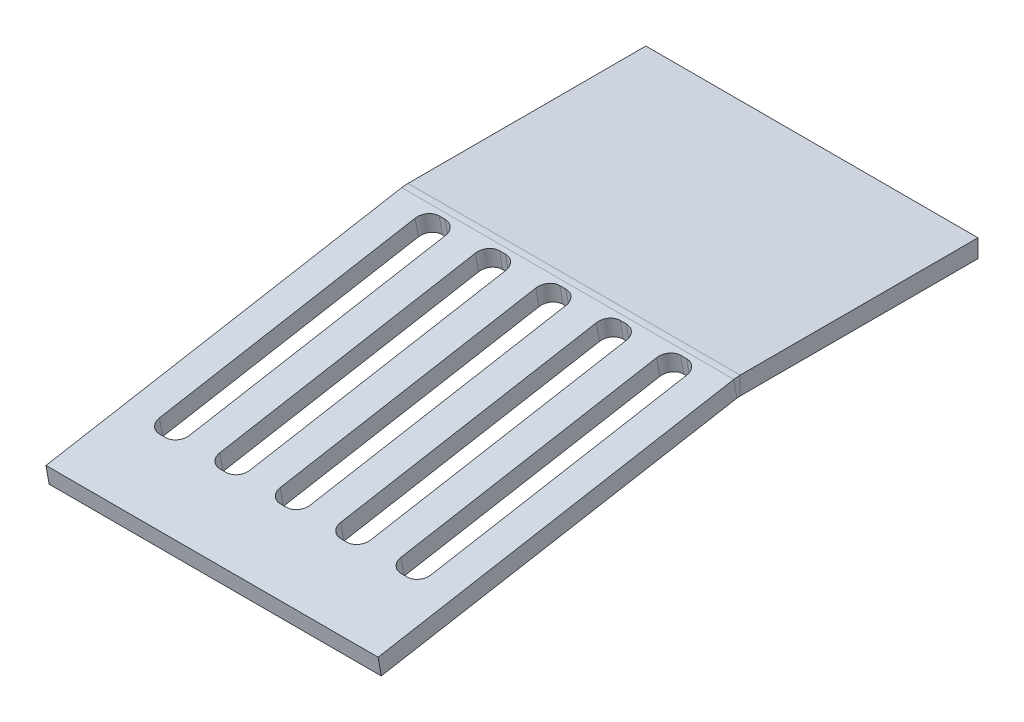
ISO-10303-21;
HEADER;
FILE_DESCRIPTION(('STEP AP214'),'2;1');
FILE_NAME('part.step','',(''),(''),'','','');
FILE_SCHEMA(('AUTOMOTIVE_DESIGN { 1 0 10303 214 1 1 1 1 }'));
ENDSEC;
DATA;
#1=APPLICATION_CONTEXT('core data for automotive mechanical design processes');
#2=APPLICATION_PROTOCOL_DEFINITION('international standard','automotive_design',2000,#1);
#3=PRODUCT_CONTEXT('',#1,'mechanical');
#4=PRODUCT('Part','Part','',(#3));
#5=PRODUCT_RELATED_PRODUCT_CATEGORY('part','',(#4));
#6=PRODUCT_DEFINITION_FORMATION('','',#4);
#7=PRODUCT_DEFINITION_CONTEXT('part definition',#1,'design');
#8=PRODUCT_DEFINITION('design','',#6,#7);
#9=PRODUCT_DEFINITION_SHAPE('','',#8);
#10=(LENGTH_UNIT() NAMED_UNIT(*) SI_UNIT(.MILLI.,.METRE.));
#11=(NAMED_UNIT(*) PLANE_ANGLE_UNIT() SI_UNIT($,.RADIAN.));
#12=(NAMED_UNIT(*) SI_UNIT($,.STERADIAN.) SOLID_ANGLE_UNIT());
#13=UNCERTAINTY_MEASURE_WITH_UNIT(LENGTH_MEASURE(1.E-05),#10,'distance_accuracy_value','');
#14=(GEOMETRIC_REPRESENTATION_CONTEXT(3) GLOBAL_UNCERTAINTY_ASSIGNED_CONTEXT((#13)) GLOBAL_UNIT_ASSIGNED_CONTEXT((#10,
#11,#12)) REPRESENTATION_CONTEXT('',''));
#15=CARTESIAN_POINT('',(0.,0.,0.));
#16=DIRECTION('',(0.,0.,1.));
#17=DIRECTION('',(1.,0.,0.));
#18=AXIS2_PLACEMENT_3D('',#15,#16,#17);
#19=CARTESIAN_POINT('',(31.344537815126,9.88534142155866,-55.1331448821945));
#20=DIRECTION('',(1.,0.,0.));
#21=DIRECTION('',(0.,0.173648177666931,-0.984807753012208));
#22=AXIS2_PLACEMENT_3D('',#19,#20,#21);
#23=PLANE('',#22);
#24=DIRECTION('',(0.,-0.173648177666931,0.984807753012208));
#25=VECTOR('',#24,1.);
#26=CARTESIAN_POINT('',(31.344537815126,-2.79337978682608,-0.50485524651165));
#27=LINE('',#26,#25);
#28=CARTESIAN_POINT('',(31.344537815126,-10.433899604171,42.8266858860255));
#29=VERTEX_POINT('',#28);
#30=CARTESIAN_POINT('',(31.344537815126,-0.0455767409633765,-16.088420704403));
#31=VERTEX_POINT('',#30);
#32=EDGE_CURVE('E466',#29,#31,#27,.F.);
#33=ORIENTED_EDGE('',*,*,#32,.T.);
#34=DIRECTION('',(0.,0.984807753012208,0.173648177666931));
#35=VECTOR('',#34,1.);
#36=CARTESIAN_POINT('',(31.344537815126,2.90884651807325,-15.5674761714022));
#37=LINE('',#36,#35);
#38=CARTESIAN_POINT('',(31.344537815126,2.90884651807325,-15.5674761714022));
#39=VERTEX_POINT('',#38);
#40=EDGE_CURVE('E454',#31,#39,#37,.T.);
#41=ORIENTED_EDGE('',*,*,#40,.T.);
#42=DIRECTION('',(0.,0.173648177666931,-0.984807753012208));
#43=VECTOR('',#42,1.);
#44=CARTESIAN_POINT('',(31.344537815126,9.88534142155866,-55.1331448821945));
#45=LINE('',#44,#43);
#46=CARTESIAN_POINT('',(31.344537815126,-7.47947634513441,43.3476304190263));
#47=VERTEX_POINT('',#46);
#48=EDGE_CURVE('E73',#47,#39,#45,.T.);
#49=ORIENTED_EDGE('',*,*,#48,.F.);
#50=DIRECTION('',(0.,0.984807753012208,0.173648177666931));
#51=VECTOR('',#50,1.);
#52=CARTESIAN_POINT('',(31.344537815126,-7.47947634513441,43.3476304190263));
#53=LINE('',#52,#51);
#54=EDGE_CURVE('E290',#29,#47,#53,.T.);
#55=ORIENTED_EDGE('',*,*,#54,.F.);
#56=EDGE_LOOP('',(#33,#41,#49,#55));
#57=FACE_BOUND('',#56,.T.);
#58=ADVANCED_FACE('F69',(#57),#23,.T.);
#59=CARTESIAN_POINT('',(-23.655462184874,9.88534142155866,-55.1331448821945));
#60=DIRECTION('',(-1.,0.,0.));
#61=DIRECTION('',(0.,-0.173648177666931,0.984807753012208));
#62=AXIS2_PLACEMENT_3D('',#59,#60,#61);
#63=PLANE('',#62);
#64=DIRECTION('',(0.,-0.173648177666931,0.984807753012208));
#65=VECTOR('',#64,1.);
#66=CARTESIAN_POINT('',(-23.655462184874,9.88534142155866,-55.1331448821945));
#67=LINE('',#66,#65);
#68=CARTESIAN_POINT('',(-23.655462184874,2.90884651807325,-15.5674761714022));
#69=VERTEX_POINT('',#68);
#70=CARTESIAN_POINT('',(-23.655462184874,-7.47947634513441,43.3476304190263));
#71=VERTEX_POINT('',#70);
#72=EDGE_CURVE('E272',#69,#71,#67,.T.);
#73=ORIENTED_EDGE('',*,*,#72,.F.);
#74=DIRECTION('',(0.,-0.984807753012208,-0.173648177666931));
#75=VECTOR('',#74,1.);
#76=CARTESIAN_POINT('',(-23.655462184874,2.90884651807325,-15.5674761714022));
#77=LINE('',#76,#75);
#78=CARTESIAN_POINT('',(-23.655462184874,-0.0455767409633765,-16.088420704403));
#79=VERTEX_POINT('',#78);
#80=EDGE_CURVE('E12',#69,#79,#77,.T.);
#81=ORIENTED_EDGE('',*,*,#80,.T.);
#82=DIRECTION('',(0.,-0.173648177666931,0.984807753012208));
#83=VECTOR('',#82,1.);
#84=CARTESIAN_POINT('',(-23.655462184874,-2.79337978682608,-0.50485524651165));
#85=LINE('',#84,#83);
#86=CARTESIAN_POINT('',(-23.655462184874,-10.433899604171,42.8266858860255));
#87=VERTEX_POINT('',#86);
#88=EDGE_CURVE('E461',#79,#87,#85,.T.);
#89=ORIENTED_EDGE('',*,*,#88,.T.);
#90=DIRECTION('',(0.,0.984807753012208,0.173648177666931));
#91=VECTOR('',#90,1.);
#92=CARTESIAN_POINT('',(-23.655462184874,-7.47947634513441,43.3476304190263));
#93=LINE('',#92,#91);
#94=EDGE_CURVE('E295',#87,#71,#93,.T.);
#95=ORIENTED_EDGE('',*,*,#94,.T.);
#96=EDGE_LOOP('',(#73,#81,#89,#95));
#97=FACE_BOUND('',#96,.T.);
#98=ADVANCED_FACE('F71',(#97),#63,.T.);
#99=CARTESIAN_POINT('',(0.,0.161043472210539,0.0160892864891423));
#100=DIRECTION('',(0.,0.984807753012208,0.173648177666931));
#101=DIRECTION('',(0.,-0.173648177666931,0.984807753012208));
#102=AXIS2_PLACEMENT_3D('',#99,#100,#101);
#103=PLANE('',#102);
#104=DIRECTION('',(0.,0.173648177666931,-0.984807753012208));
#105=VECTOR('',#104,1.);
#106=CARTESIAN_POINT('',(16.344537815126,-5.04840185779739,29.5603218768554));
#107=LINE('',#106,#105);
#108=CARTESIAN_POINT('',(16.344537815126,-5.04840185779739,29.5603218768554));
#109=VERTEX_POINT('',#108);
#110=CARTESIAN_POINT('',(16.344537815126,2.41846978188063,-12.7864115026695));
#111=VERTEX_POINT('',#110);
#112=EDGE_CURVE('E483',#109,#111,#107,.T.);
#113=ORIENTED_EDGE('',*,*,#112,.F.);
#114=CARTESIAN_POINT('',(14.344537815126,-5.04840185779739,29.5603218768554));
#115=DIRECTION('',(0.,0.984807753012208,0.173648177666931));
#116=DIRECTION('',(0.,-0.173648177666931,0.984807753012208));
#117=AXIS2_PLACEMENT_3D('',#114,#115,#116);
#118=CIRCLE('',#117,2.);
#119=CARTESIAN_POINT('',(14.344537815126,-5.39569821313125,31.5299373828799));
#120=VERTEX_POINT('',#119);
#121=EDGE_CURVE('E491',#120,#109,#118,.T.);
#122=ORIENTED_EDGE('',*,*,#121,.F.);
#123=DIRECTION('',(1.,0.,0.));
#124=VECTOR('',#123,1.);
#125=CARTESIAN_POINT('',(14.344537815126,-5.39569821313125,31.5299373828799));
#126=LINE('',#125,#124);
#127=CARTESIAN_POINT('',(13.344537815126,-5.39569821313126,31.5299373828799));
#128=VERTEX_POINT('',#127);
#129=EDGE_CURVE('E495',#128,#120,#126,.T.);
#130=ORIENTED_EDGE('',*,*,#129,.F.);
#131=CARTESIAN_POINT('',(13.344537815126,-5.04840185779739,29.5603218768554));
#132=DIRECTION('',(0.,0.984807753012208,0.173648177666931));
#133=DIRECTION('',(0.,0.173648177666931,-0.984807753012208));
#134=AXIS2_PLACEMENT_3D('',#131,#132,#133);
#135=CIRCLE('',#134,2.);
#136=CARTESIAN_POINT('',(11.344537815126,-5.04840185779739,29.5603218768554));
#137=VERTEX_POINT('',#136);
#138=EDGE_CURVE('E499',#137,#128,#135,.T.);
#139=ORIENTED_EDGE('',*,*,#138,.F.);
#140=DIRECTION('',(0.,-0.173648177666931,0.984807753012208));
#141=VECTOR('',#140,1.);
#142=CARTESIAN_POINT('',(11.344537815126,-5.04840185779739,29.5603218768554));
#143=LINE('',#142,#141);
#144=CARTESIAN_POINT('',(11.344537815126,2.41846978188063,-12.7864115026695));
#145=VERTEX_POINT('',#144);
#146=EDGE_CURVE('E503',#145,#137,#143,.T.);
#147=ORIENTED_EDGE('',*,*,#146,.F.);
#148=CARTESIAN_POINT('',(13.344537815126,2.41846978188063,-12.7864115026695));
#149=DIRECTION('',(0.,0.984807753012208,0.173648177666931));
#150=DIRECTION('',(0.,0.173648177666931,-0.984807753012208));
#151=AXIS2_PLACEMENT_3D('',#148,#149,#150);
#152=CIRCLE('',#151,2.);
#153=CARTESIAN_POINT('',(13.344537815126,2.76576613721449,-14.7560270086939));
#154=VERTEX_POINT('',#153);
#155=EDGE_CURVE('E507',#154,#145,#152,.T.);
#156=ORIENTED_EDGE('',*,*,#155,.F.);
#157=DIRECTION('',(-1.,0.,0.));
#158=VECTOR('',#157,1.);
#159=CARTESIAN_POINT('',(14.344537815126,2.76576613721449,-14.7560270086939));
#160=LINE('',#159,#158);
#161=CARTESIAN_POINT('',(14.344537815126,2.76576613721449,-14.7560270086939));
#162=VERTEX_POINT('',#161);
#163=EDGE_CURVE('E511',#162,#154,#160,.T.);
#164=ORIENTED_EDGE('',*,*,#163,.F.);
#165=CARTESIAN_POINT('',(14.344537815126,2.41846978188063,-12.7864115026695));
#166=DIRECTION('',(0.,0.984807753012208,0.173648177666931));
#167=DIRECTION('',(0.,-0.173648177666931,0.984807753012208));
#168=AXIS2_PLACEMENT_3D('',#165,#166,#167);
#169=CIRCLE('',#168,2.);
#170=EDGE_CURVE('E515',#111,#162,#169,.T.);
#171=ORIENTED_EDGE('',*,*,#170,.F.);
#172=EDGE_LOOP('',(#113,#122,#130,#139,#147,#156,#164,#171));
#173=FACE_BOUND('',#172,.T.);
#174=DIRECTION('',(0.,0.173648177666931,-0.984807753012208));
#175=VECTOR('',#174,1.);
#176=CARTESIAN_POINT('',(6.34453781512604,-5.04840185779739,29.5603218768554));
#177=LINE('',#176,#175);
#178=CARTESIAN_POINT('',(6.34453781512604,-5.04840185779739,29.5603218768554));
#179=VERTEX_POINT('',#178);
#180=CARTESIAN_POINT('',(6.34453781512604,2.41846978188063,-12.7864115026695));
#181=VERTEX_POINT('',#180);
#182=EDGE_CURVE('E519',#179,#181,#177,.T.);
#183=ORIENTED_EDGE('',*,*,#182,.F.);
#184=CARTESIAN_POINT('',(4.34453781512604,-5.04840185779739,29.5603218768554));
#185=DIRECTION('',(0.,0.984807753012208,0.173648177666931));
#186=DIRECTION('',(0.,-0.173648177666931,0.984807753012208));
#187=AXIS2_PLACEMENT_3D('',#184,#185,#186);
#188=CIRCLE('',#187,2.);
#189=CARTESIAN_POINT('',(4.34453781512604,-5.39569821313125,31.5299373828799));
#190=VERTEX_POINT('',#189);
#191=EDGE_CURVE('E523',#190,#179,#188,.T.);
#192=ORIENTED_EDGE('',*,*,#191,.F.);
#193=DIRECTION('',(1.,0.,0.));
#194=VECTOR('',#193,1.);
#195=CARTESIAN_POINT('',(4.34453781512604,-5.39569821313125,31.5299373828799));
#196=LINE('',#195,#194);
#197=CARTESIAN_POINT('',(3.34453781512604,-5.39569821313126,31.5299373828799));
#198=VERTEX_POINT('',#197);
#199=EDGE_CURVE('E527',#198,#190,#196,.T.);
#200=ORIENTED_EDGE('',*,*,#199,.F.);
#201=CARTESIAN_POINT('',(3.34453781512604,-5.04840185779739,29.5603218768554));
#202=DIRECTION('',(0.,0.984807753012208,0.173648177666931));
#203=DIRECTION('',(0.,0.173648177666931,-0.984807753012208));
#204=AXIS2_PLACEMENT_3D('',#201,#202,#203);
#205=CIRCLE('',#204,2.);
#206=CARTESIAN_POINT('',(1.34453781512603,-5.04840185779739,29.5603218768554));
#207=VERTEX_POINT('',#206);
#208=EDGE_CURVE('E531',#207,#198,#205,.T.);
#209=ORIENTED_EDGE('',*,*,#208,.F.);
#210=DIRECTION('',(0.,-0.173648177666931,0.984807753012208));
#211=VECTOR('',#210,1.);
#212=CARTESIAN_POINT('',(1.34453781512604,-5.04840185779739,29.5603218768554));
#213=LINE('',#212,#211);
#214=CARTESIAN_POINT('',(1.34453781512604,2.41846978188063,-12.7864115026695));
#215=VERTEX_POINT('',#214);
#216=EDGE_CURVE('E535',#215,#207,#213,.T.);
#217=ORIENTED_EDGE('',*,*,#216,.F.);
#218=CARTESIAN_POINT('',(3.34453781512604,2.41846978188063,-12.7864115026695));
#219=DIRECTION('',(0.,0.984807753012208,0.173648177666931));
#220=DIRECTION('',(0.,0.173648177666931,-0.984807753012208));
#221=AXIS2_PLACEMENT_3D('',#218,#219,#220);
#222=CIRCLE('',#221,2.);
#223=CARTESIAN_POINT('',(3.34453781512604,2.76576613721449,-14.7560270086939));
#224=VERTEX_POINT('',#223);
#225=EDGE_CURVE('E539',#224,#215,#222,.T.);
#226=ORIENTED_EDGE('',*,*,#225,.F.);
#227=DIRECTION('',(-1.,0.,0.));
#228=VECTOR('',#227,1.);
#229=CARTESIAN_POINT('',(4.34453781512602,2.76576613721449,-14.7560270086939));
#230=LINE('',#229,#228);
#231=CARTESIAN_POINT('',(4.34453781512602,2.76576613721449,-14.7560270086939));
#232=VERTEX_POINT('',#231);
#233=EDGE_CURVE('E543',#232,#224,#230,.T.);
#234=ORIENTED_EDGE('',*,*,#233,.F.);
#235=CARTESIAN_POINT('',(4.34453781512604,2.41846978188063,-12.7864115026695));
#236=DIRECTION('',(0.,0.984807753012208,0.173648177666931));
#237=DIRECTION('',(0.,-0.173648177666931,0.984807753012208));
#238=AXIS2_PLACEMENT_3D('',#235,#236,#237);
#239=CIRCLE('',#238,2.);
#240=EDGE_CURVE('E547',#181,#232,#239,.T.);
#241=ORIENTED_EDGE('',*,*,#240,.F.);
#242=EDGE_LOOP('',(#183,#192,#200,#209,#217,#226,#234,#241));
#243=FACE_BOUND('',#242,.T.);
#244=DIRECTION('',(0.,0.173648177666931,-0.984807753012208));
#245=VECTOR('',#244,1.);
#246=CARTESIAN_POINT('',(-3.65546218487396,-5.0484018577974,29.5603218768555));
#247=LINE('',#246,#245);
#248=CARTESIAN_POINT('',(-3.65546218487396,-5.0484018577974,29.5603218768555));
#249=VERTEX_POINT('',#248);
#250=CARTESIAN_POINT('',(-3.65546218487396,2.41846978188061,-12.7864115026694));
#251=VERTEX_POINT('',#250);
#252=EDGE_CURVE('E551',#249,#251,#247,.T.);
#253=ORIENTED_EDGE('',*,*,#252,.F.);
#254=CARTESIAN_POINT('',(-5.65546218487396,-5.0484018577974,29.5603218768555));
#255=DIRECTION('',(0.,0.984807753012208,0.173648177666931));
#256=DIRECTION('',(0.,-0.173648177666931,0.984807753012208));
#257=AXIS2_PLACEMENT_3D('',#254,#255,#256);
#258=CIRCLE('',#257,2.);
#259=CARTESIAN_POINT('',(-5.65546218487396,-5.39569821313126,31.5299373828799));
#260=VERTEX_POINT('',#259);
#261=EDGE_CURVE('E555',#260,#249,#258,.T.);
#262=ORIENTED_EDGE('',*,*,#261,.F.);
#263=DIRECTION('',(1.,0.,0.));
#264=VECTOR('',#263,1.);
#265=CARTESIAN_POINT('',(-5.65546218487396,-5.39569821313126,31.5299373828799));
#266=LINE('',#265,#264);
#267=CARTESIAN_POINT('',(-6.65546218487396,-5.39569821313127,31.5299373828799));
#268=VERTEX_POINT('',#267);
#269=EDGE_CURVE('E559',#268,#260,#266,.T.);
#270=ORIENTED_EDGE('',*,*,#269,.F.);
#271=CARTESIAN_POINT('',(-6.65546218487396,-5.0484018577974,29.5603218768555));
#272=DIRECTION('',(0.,0.984807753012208,0.173648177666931));
#273=DIRECTION('',(0.,0.173648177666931,-0.984807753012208));
#274=AXIS2_PLACEMENT_3D('',#271,#272,#273);
#275=CIRCLE('',#274,2.);
#276=CARTESIAN_POINT('',(-8.65546218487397,-5.0484018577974,29.5603218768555));
#277=VERTEX_POINT('',#276);
#278=EDGE_CURVE('E563',#277,#268,#275,.T.);
#279=ORIENTED_EDGE('',*,*,#278,.F.);
#280=DIRECTION('',(0.,-0.173648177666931,0.984807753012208));
#281=VECTOR('',#280,1.);
#282=CARTESIAN_POINT('',(-8.65546218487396,-5.0484018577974,29.5603218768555));
#283=LINE('',#282,#281);
#284=CARTESIAN_POINT('',(-8.65546218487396,2.41846978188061,-12.7864115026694));
#285=VERTEX_POINT('',#284);
#286=EDGE_CURVE('E567',#285,#277,#283,.T.);
#287=ORIENTED_EDGE('',*,*,#286,.F.);
#288=CARTESIAN_POINT('',(-6.65546218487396,2.41846978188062,-12.7864115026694));
#289=DIRECTION('',(0.,0.984807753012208,0.173648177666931));
#290=DIRECTION('',(0.,0.173648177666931,-0.984807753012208));
#291=AXIS2_PLACEMENT_3D('',#288,#289,#290);
#292=CIRCLE('',#291,2.);
#293=CARTESIAN_POINT('',(-6.65546218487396,2.76576613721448,-14.7560270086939));
#294=VERTEX_POINT('',#293);
#295=EDGE_CURVE('E571',#294,#285,#292,.T.);
#296=ORIENTED_EDGE('',*,*,#295,.F.);
#297=DIRECTION('',(-1.,0.,0.));
#298=VECTOR('',#297,1.);
#299=CARTESIAN_POINT('',(-5.65546218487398,2.76576613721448,-14.7560270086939));
#300=LINE('',#299,#298);
#301=CARTESIAN_POINT('',(-5.65546218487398,2.76576613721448,-14.7560270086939));
#302=VERTEX_POINT('',#301);
#303=EDGE_CURVE('E575',#302,#294,#300,.T.);
#304=ORIENTED_EDGE('',*,*,#303,.F.);
#305=CARTESIAN_POINT('',(-5.65546218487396,2.41846978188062,-12.7864115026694));
#306=DIRECTION('',(0.,0.984807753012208,0.173648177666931));
#307=DIRECTION('',(0.,-0.173648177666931,0.984807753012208));
#308=AXIS2_PLACEMENT_3D('',#305,#306,#307);
#309=CIRCLE('',#308,2.);
#310=EDGE_CURVE('E579',#251,#302,#309,.T.);
#311=ORIENTED_EDGE('',*,*,#310,.F.);
#312=EDGE_LOOP('',(#253,#262,#270,#279,#287,#296,#304,#311));
#313=FACE_BOUND('',#312,.T.);
#314=DIRECTION('',(0.,0.173648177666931,-0.984807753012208));
#315=VECTOR('',#314,1.);
#316=CARTESIAN_POINT('',(-13.655462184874,-5.04840185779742,29.5603218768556));
#317=LINE('',#316,#315);
#318=CARTESIAN_POINT('',(-13.655462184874,-5.04840185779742,29.5603218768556));
#319=VERTEX_POINT('',#318);
#320=CARTESIAN_POINT('',(-13.655462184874,2.4184697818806,-12.7864115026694));
#321=VERTEX_POINT('',#320);
#322=EDGE_CURVE('E583',#319,#321,#317,.T.);
#323=ORIENTED_EDGE('',*,*,#322,.F.);
#324=CARTESIAN_POINT('',(-15.655462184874,-5.04840185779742,29.5603218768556));
#325=DIRECTION('',(0.,0.984807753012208,0.173648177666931));
#326=DIRECTION('',(0.,-0.173648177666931,0.984807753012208));
#327=AXIS2_PLACEMENT_3D('',#324,#325,#326);
#328=CIRCLE('',#327,2.);
#329=CARTESIAN_POINT('',(-15.655462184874,-5.39569821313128,31.52993738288));
#330=VERTEX_POINT('',#329);
#331=EDGE_CURVE('E587',#330,#319,#328,.T.);
#332=ORIENTED_EDGE('',*,*,#331,.F.);
#333=DIRECTION('',(1.,0.,0.));
#334=VECTOR('',#333,1.);
#335=CARTESIAN_POINT('',(-15.655462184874,-5.39569821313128,31.52993738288));
#336=LINE('',#335,#334);
#337=CARTESIAN_POINT('',(-16.655462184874,-5.39569821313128,31.52993738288));
#338=VERTEX_POINT('',#337);
#339=EDGE_CURVE('E591',#338,#330,#336,.T.);
#340=ORIENTED_EDGE('',*,*,#339,.F.);
#341=CARTESIAN_POINT('',(-16.655462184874,-5.04840185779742,29.5603218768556));
#342=DIRECTION('',(0.,0.984807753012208,0.173648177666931));
#343=DIRECTION('',(0.,0.173648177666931,-0.984807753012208));
#344=AXIS2_PLACEMENT_3D('',#341,#342,#343);
#345=CIRCLE('',#344,2.00000000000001);
#346=CARTESIAN_POINT('',(-18.655462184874,-5.04840185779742,29.5603218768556));
#347=VERTEX_POINT('',#346);
#348=EDGE_CURVE('E595',#347,#338,#345,.T.);
#349=ORIENTED_EDGE('',*,*,#348,.F.);
#350=DIRECTION('',(0.,-0.173648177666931,0.984807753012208));
#351=VECTOR('',#350,1.);
#352=CARTESIAN_POINT('',(-18.655462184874,-5.04840185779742,29.5603218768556));
#353=LINE('',#352,#351);
#354=CARTESIAN_POINT('',(-18.655462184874,2.4184697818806,-12.7864115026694));
#355=VERTEX_POINT('',#354);
#356=EDGE_CURVE('E599',#355,#347,#353,.T.);
#357=ORIENTED_EDGE('',*,*,#356,.F.);
#358=CARTESIAN_POINT('',(-16.655462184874,2.4184697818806,-12.7864115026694));
#359=DIRECTION('',(0.,0.984807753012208,0.173648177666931));
#360=DIRECTION('',(0.,0.173648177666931,-0.984807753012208));
#361=AXIS2_PLACEMENT_3D('',#358,#359,#360);
#362=CIRCLE('',#361,2.);
#363=CARTESIAN_POINT('',(-16.655462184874,2.76576613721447,-14.7560270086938));
#364=VERTEX_POINT('',#363);
#365=EDGE_CURVE('E603',#364,#355,#362,.T.);
#366=ORIENTED_EDGE('',*,*,#365,.F.);
#367=DIRECTION('',(-1.,0.,0.));
#368=VECTOR('',#367,1.);
#369=CARTESIAN_POINT('',(-15.655462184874,2.76576613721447,-14.7560270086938));
#370=LINE('',#369,#368);
#371=CARTESIAN_POINT('',(-15.655462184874,2.76576613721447,-14.7560270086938));
#372=VERTEX_POINT('',#371);
#373=EDGE_CURVE('E607',#372,#364,#370,.T.);
#374=ORIENTED_EDGE('',*,*,#373,.F.);
#375=CARTESIAN_POINT('',(-15.655462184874,2.4184697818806,-12.7864115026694));
#376=DIRECTION('',(0.,0.984807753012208,0.173648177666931));
#377=DIRECTION('',(0.,-0.173648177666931,0.984807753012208));
#378=AXIS2_PLACEMENT_3D('',#375,#376,#377);
#379=CIRCLE('',#378,2.);
#380=EDGE_CURVE('E611',#321,#372,#379,.T.);
#381=ORIENTED_EDGE('',*,*,#380,.F.);
#382=EDGE_LOOP('',(#323,#332,#340,#349,#357,#366,#374,#381));
#383=FACE_BOUND('',#382,.T.);
#384=DIRECTION('',(0.,0.173648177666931,-0.984807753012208));
#385=VECTOR('',#384,1.);
#386=CARTESIAN_POINT('',(26.344537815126,-5.04840185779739,29.5603218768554));
#387=LINE('',#386,#385);
#388=CARTESIAN_POINT('',(26.344537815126,-5.04840185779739,29.5603218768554));
#389=VERTEX_POINT('',#388);
#390=CARTESIAN_POINT('',(26.344537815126,2.41846978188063,-12.7864115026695));
#391=VERTEX_POINT('',#390);
#392=EDGE_CURVE('E615',#389,#391,#387,.T.);
#393=ORIENTED_EDGE('',*,*,#392,.F.);
#394=CARTESIAN_POINT('',(24.344537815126,-5.04840185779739,29.5603218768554));
#395=DIRECTION('',(0.,0.984807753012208,0.173648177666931));
#396=DIRECTION('',(0.,-0.173648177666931,0.984807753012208));
#397=AXIS2_PLACEMENT_3D('',#394,#395,#396);
#398=CIRCLE('',#397,2.);
#399=CARTESIAN_POINT('',(24.344537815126,-5.39569821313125,31.5299373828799));
#400=VERTEX_POINT('',#399);
#401=EDGE_CURVE('E239',#400,#389,#398,.T.);
#402=ORIENTED_EDGE('',*,*,#401,.F.);
#403=DIRECTION('',(1.,0.,0.));
#404=VECTOR('',#403,1.);
#405=CARTESIAN_POINT('',(24.344537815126,-5.39569821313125,31.5299373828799));
#406=LINE('',#405,#404);
#407=CARTESIAN_POINT('',(23.344537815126,-5.39569821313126,31.5299373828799));
#408=VERTEX_POINT('',#407);
#409=EDGE_CURVE('E620',#408,#400,#406,.T.);
#410=ORIENTED_EDGE('',*,*,#409,.F.);
#411=CARTESIAN_POINT('',(23.344537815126,-5.04840185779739,29.5603218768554));
#412=DIRECTION('',(0.,0.984807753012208,0.173648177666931));
#413=DIRECTION('',(0.,0.173648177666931,-0.984807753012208));
#414=AXIS2_PLACEMENT_3D('',#411,#412,#413);
#415=CIRCLE('',#414,2.);
#416=CARTESIAN_POINT('',(21.344537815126,-5.04840185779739,29.5603218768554));
#417=VERTEX_POINT('',#416);
#418=EDGE_CURVE('E624',#417,#408,#415,.T.);
#419=ORIENTED_EDGE('',*,*,#418,.F.);
#420=DIRECTION('',(0.,-0.173648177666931,0.984807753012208));
#421=VECTOR('',#420,1.);
#422=CARTESIAN_POINT('',(21.344537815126,-5.04840185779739,29.5603218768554));
#423=LINE('',#422,#421);
#424=CARTESIAN_POINT('',(21.344537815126,2.41846978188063,-12.7864115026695));
#425=VERTEX_POINT('',#424);
#426=EDGE_CURVE('E628',#425,#417,#423,.T.);
#427=ORIENTED_EDGE('',*,*,#426,.F.);
#428=CARTESIAN_POINT('',(23.344537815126,2.41846978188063,-12.7864115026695));
#429=DIRECTION('',(0.,0.984807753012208,0.173648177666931));
#430=DIRECTION('',(0.,0.173648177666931,-0.984807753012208));
#431=AXIS2_PLACEMENT_3D('',#428,#429,#430);
#432=CIRCLE('',#431,2.);
#433=CARTESIAN_POINT('',(23.344537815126,2.76576613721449,-14.7560270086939));
#434=VERTEX_POINT('',#433);
#435=EDGE_CURVE('E632',#434,#425,#432,.T.);
#436=ORIENTED_EDGE('',*,*,#435,.F.);
#437=DIRECTION('',(-1.,0.,0.));
#438=VECTOR('',#437,1.);
#439=CARTESIAN_POINT('',(24.344537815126,2.76576613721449,-14.7560270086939));
#440=LINE('',#439,#438);
#441=CARTESIAN_POINT('',(24.344537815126,2.76576613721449,-14.7560270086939));
#442=VERTEX_POINT('',#441);
#443=EDGE_CURVE('E636',#442,#434,#440,.T.);
#444=ORIENTED_EDGE('',*,*,#443,.F.);
#445=CARTESIAN_POINT('',(24.344537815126,2.41846978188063,-12.7864115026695));
#446=DIRECTION('',(0.,0.984807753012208,0.173648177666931));
#447=DIRECTION('',(0.,-0.173648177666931,0.984807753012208));
#448=AXIS2_PLACEMENT_3D('',#445,#446,#447);
#449=CIRCLE('',#448,2.);
#450=EDGE_CURVE('E299',#391,#442,#449,.T.);
#451=ORIENTED_EDGE('',*,*,#450,.F.);
#452=EDGE_LOOP('',(#393,#402,#410,#419,#427,#436,#444,#451));
#453=FACE_BOUND('',#452,.T.);
#454=ORIENTED_EDGE('',*,*,#48,.T.);
#455=DIRECTION('',(-1.,0.,0.));
#456=VECTOR('',#455,1.);
#457=CARTESIAN_POINT('',(0.,2.90884651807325,-15.5674761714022));
#458=LINE('',#457,#456);
#459=EDGE_CURVE('E449',#39,#69,#458,.T.);
#460=ORIENTED_EDGE('',*,*,#459,.T.);
#461=ORIENTED_EDGE('',*,*,#72,.T.);
#462=DIRECTION('',(1.,0.,0.));
#463=VECTOR('',#462,1.);
#464=CARTESIAN_POINT('',(-23.655462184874,-7.47947634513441,43.3476304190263));
#465=LINE('',#464,#463);
#466=EDGE_CURVE('E472',#71,#47,#465,.T.);
#467=ORIENTED_EDGE('',*,*,#466,.T.);
#468=EDGE_LOOP('',(#454,#460,#461,#467));
#469=FACE_BOUND('',#468,.T.);
#470=ADVANCED_FACE('F800',(#173,#243,#313,#383,#453,#469),#103,.T.);
#471=CARTESIAN_POINT('',(24.344537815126,-5.39569821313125,31.5299373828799));
#472=DIRECTION('',(0.,-0.173648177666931,0.984807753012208));
#473=DIRECTION('',(1.,0.,0.));
#474=AXIS2_PLACEMENT_3D('',#471,#472,#473);
#475=PLANE('',#474);
#476=DIRECTION('',(0.,0.984807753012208,0.173648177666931));
#477=VECTOR('',#476,1.);
#478=CARTESIAN_POINT('',(24.344537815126,-5.39569821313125,31.5299373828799));
#479=LINE('',#478,#477);
#480=CARTESIAN_POINT('',(24.344537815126,-8.35012147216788,31.0089928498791));
#481=VERTEX_POINT('',#480);
#482=EDGE_CURVE('E447',#481,#400,#479,.T.);
#483=ORIENTED_EDGE('',*,*,#482,.F.);
#484=DIRECTION('',(1.,0.,0.));
#485=VECTOR('',#484,1.);
#486=CARTESIAN_POINT('',(0.,-8.35012147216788,31.0089928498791));
#487=LINE('',#486,#485);
#488=CARTESIAN_POINT('',(23.344537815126,-8.35012147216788,31.0089928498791));
#489=VERTEX_POINT('',#488);
#490=EDGE_CURVE('E254',#489,#481,#487,.T.);
#491=ORIENTED_EDGE('',*,*,#490,.F.);
#492=DIRECTION('',(0.,0.984807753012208,0.173648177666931));
#493=VECTOR('',#492,1.);
#494=CARTESIAN_POINT('',(23.344537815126,-5.39569821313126,31.5299373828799));
#495=LINE('',#494,#493);
#496=EDGE_CURVE('E443',#489,#408,#495,.T.);
#497=ORIENTED_EDGE('',*,*,#496,.T.);
#498=ORIENTED_EDGE('',*,*,#409,.T.);
#499=EDGE_LOOP('',(#483,#491,#497,#498));
#500=FACE_BOUND('',#499,.T.);
#501=ADVANCED_FACE('F807',(#500),#475,.F.);
#502=CARTESIAN_POINT('',(23.344537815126,-5.04840185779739,29.5603218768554));
#503=DIRECTION('',(0.,0.984807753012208,0.173648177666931));
#504=DIRECTION('',(0.,-0.173648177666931,0.984807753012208));
#505=AXIS2_PLACEMENT_3D('',#502,#503,#504);
#506=CYLINDRICAL_SURFACE('',#505,2.);
#507=ORIENTED_EDGE('',*,*,#496,.F.);
#508=CARTESIAN_POINT('',(23.344537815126,-8.00282511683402,29.0393773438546));
#509=DIRECTION('',(0.,0.984807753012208,0.173648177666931));
#510=DIRECTION('',(0.,-0.173648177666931,0.984807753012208));
#511=AXIS2_PLACEMENT_3D('',#508,#509,#510);
#512=CIRCLE('',#511,2.);
#513=CARTESIAN_POINT('',(21.344537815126,-8.00282511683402,29.0393773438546));
#514=VERTEX_POINT('',#513);
#515=EDGE_CURVE('E285',#514,#489,#512,.T.);
#516=ORIENTED_EDGE('',*,*,#515,.F.);
#517=DIRECTION('',(0.,0.984807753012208,0.173648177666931));
#518=VECTOR('',#517,1.);
#519=CARTESIAN_POINT('',(21.344537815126,-5.04840185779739,29.5603218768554));
#520=LINE('',#519,#518);
#521=EDGE_CURVE('E439',#514,#417,#520,.T.);
#522=ORIENTED_EDGE('',*,*,#521,.T.);
#523=ORIENTED_EDGE('',*,*,#418,.T.);
#524=EDGE_LOOP('',(#507,#516,#522,#523));
#525=FACE_BOUND('',#524,.T.);
#526=ADVANCED_FACE('F810',(#525),#506,.F.);
#527=CARTESIAN_POINT('',(21.344537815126,-5.04840185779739,29.5603218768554));
#528=DIRECTION('',(-1.,0.,0.));
#529=DIRECTION('',(0.,-0.173648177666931,0.984807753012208));
#530=AXIS2_PLACEMENT_3D('',#527,#528,#529);
#531=PLANE('',#530);
#532=ORIENTED_EDGE('',*,*,#521,.F.);
#533=DIRECTION('',(0.,-0.173648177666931,0.984807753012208));
#534=VECTOR('',#533,1.);
#535=CARTESIAN_POINT('',(21.344537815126,-2.79337978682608,-0.50485524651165));
#536=LINE('',#535,#534);
#537=CARTESIAN_POINT('',(21.344537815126,-0.535953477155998,-13.3073560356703));
#538=VERTEX_POINT('',#537);
#539=EDGE_CURVE('E281',#538,#514,#536,.T.);
#540=ORIENTED_EDGE('',*,*,#539,.F.);
#541=DIRECTION('',(0.,0.984807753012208,0.173648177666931));
#542=VECTOR('',#541,1.);
#543=CARTESIAN_POINT('',(21.344537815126,2.41846978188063,-12.7864115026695));
#544=LINE('',#543,#542);
#545=EDGE_CURVE('E435',#538,#425,#544,.T.);
#546=ORIENTED_EDGE('',*,*,#545,.T.);
#547=ORIENTED_EDGE('',*,*,#426,.T.);
#548=EDGE_LOOP('',(#532,#540,#546,#547));
#549=FACE_BOUND('',#548,.T.);
#550=ADVANCED_FACE('F813',(#549),#531,.F.);
#551=CARTESIAN_POINT('',(23.344537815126,2.41846978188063,-12.7864115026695));
#552=DIRECTION('',(0.,0.984807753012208,0.173648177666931));
#553=DIRECTION('',(0.,-0.173648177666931,0.984807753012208));
#554=AXIS2_PLACEMENT_3D('',#551,#552,#553);
#555=CYLINDRICAL_SURFACE('',#554,2.);
#556=ORIENTED_EDGE('',*,*,#545,.F.);
#557=CARTESIAN_POINT('',(23.344537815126,-0.535953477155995,-13.3073560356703));
#558=DIRECTION('',(0.,0.984807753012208,0.173648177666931));
#559=DIRECTION('',(0.,-0.173648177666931,0.984807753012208));
#560=AXIS2_PLACEMENT_3D('',#557,#558,#559);
#561=CIRCLE('',#560,2.);
#562=CARTESIAN_POINT('',(23.344537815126,-0.188657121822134,-15.2769715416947));
#563=VERTEX_POINT('',#562);
#564=EDGE_CURVE('E277',#563,#538,#561,.T.);
#565=ORIENTED_EDGE('',*,*,#564,.F.);
#566=DIRECTION('',(0.,0.984807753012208,0.173648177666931));
#567=VECTOR('',#566,1.);
#568=CARTESIAN_POINT('',(23.344537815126,2.76576613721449,-14.7560270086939));
#569=LINE('',#568,#567);
#570=EDGE_CURVE('E431',#563,#434,#569,.T.);
#571=ORIENTED_EDGE('',*,*,#570,.T.);
#572=ORIENTED_EDGE('',*,*,#435,.T.);
#573=EDGE_LOOP('',(#556,#565,#571,#572));
#574=FACE_BOUND('',#573,.T.);
#575=ADVANCED_FACE('F794',(#574),#555,.F.);
#576=CARTESIAN_POINT('',(24.344537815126,2.76576613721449,-14.7560270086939));
#577=DIRECTION('',(0.,0.173648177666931,-0.984807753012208));
#578=DIRECTION('',(-1.,0.,0.));
#579=AXIS2_PLACEMENT_3D('',#576,#577,#578);
#580=PLANE('',#579);
#581=ORIENTED_EDGE('',*,*,#570,.F.);
#582=DIRECTION('',(1.,0.,0.));
#583=VECTOR('',#582,1.);
#584=CARTESIAN_POINT('',(0.,-0.188657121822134,-15.2769715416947));
#585=LINE('',#584,#583);
#586=CARTESIAN_POINT('',(24.344537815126,-0.188657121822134,-15.2769715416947));
#587=VERTEX_POINT('',#586);
#588=EDGE_CURVE('E273',#587,#563,#585,.F.);
#589=ORIENTED_EDGE('',*,*,#588,.F.);
#590=DIRECTION('',(0.,0.984807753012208,0.173648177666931));
#591=VECTOR('',#590,1.);
#592=CARTESIAN_POINT('',(24.344537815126,2.76576613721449,-14.7560270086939));
#593=LINE('',#592,#591);
#594=EDGE_CURVE('E428',#587,#442,#593,.T.);
#595=ORIENTED_EDGE('',*,*,#594,.T.);
#596=ORIENTED_EDGE('',*,*,#443,.T.);
#597=EDGE_LOOP('',(#581,#589,#595,#596));
#598=FACE_BOUND('',#597,.T.);
#599=ADVANCED_FACE('F803',(#598),#580,.F.);
#600=CARTESIAN_POINT('',(24.344537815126,2.41846978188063,-12.7864115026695));
#601=DIRECTION('',(0.,0.984807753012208,0.173648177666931));
#602=DIRECTION('',(0.,-0.173648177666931,0.984807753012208));
#603=AXIS2_PLACEMENT_3D('',#600,#601,#602);
#604=CYLINDRICAL_SURFACE('',#603,2.);
#605=ORIENTED_EDGE('',*,*,#594,.F.);
#606=CARTESIAN_POINT('',(24.344537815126,-0.535953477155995,-13.3073560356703));
#607=DIRECTION('',(0.,0.984807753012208,0.173648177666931));
#608=DIRECTION('',(0.,-0.173648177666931,0.984807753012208));
#609=AXIS2_PLACEMENT_3D('',#606,#607,#608);
#610=CIRCLE('',#609,2.);
#611=CARTESIAN_POINT('',(26.344537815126,-0.535953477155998,-13.3073560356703));
#612=VERTEX_POINT('',#611);
#613=EDGE_CURVE('E269',#612,#587,#610,.T.);
#614=ORIENTED_EDGE('',*,*,#613,.F.);
#615=DIRECTION('',(0.,0.984807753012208,0.173648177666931));
#616=VECTOR('',#615,1.);
#617=CARTESIAN_POINT('',(26.344537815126,2.41846978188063,-12.7864115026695));
#618=LINE('',#617,#616);
#619=EDGE_CURVE('E96',#612,#391,#618,.T.);
#620=ORIENTED_EDGE('',*,*,#619,.T.);
#621=ORIENTED_EDGE('',*,*,#450,.T.);
#622=EDGE_LOOP('',(#605,#614,#620,#621));
#623=FACE_BOUND('',#622,.T.);
#624=ADVANCED_FACE('F804',(#623),#604,.F.);
#625=CARTESIAN_POINT('',(26.344537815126,-5.04840185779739,29.5603218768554));
#626=DIRECTION('',(1.,0.,0.));
#627=DIRECTION('',(0.,0.173648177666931,-0.984807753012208));
#628=AXIS2_PLACEMENT_3D('',#625,#626,#627);
#629=PLANE('',#628);
#630=ORIENTED_EDGE('',*,*,#619,.F.);
#631=DIRECTION('',(0.,-0.173648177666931,0.984807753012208));
#632=VECTOR('',#631,1.);
#633=CARTESIAN_POINT('',(26.344537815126,-2.79337978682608,-0.50485524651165));
#634=LINE('',#633,#632);
#635=CARTESIAN_POINT('',(26.344537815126,-8.00282511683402,29.0393773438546));
#636=VERTEX_POINT('',#635);
#637=EDGE_CURVE('E251',#636,#612,#634,.F.);
#638=ORIENTED_EDGE('',*,*,#637,.F.);
#639=DIRECTION('',(0.,0.984807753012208,0.173648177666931));
#640=VECTOR('',#639,1.);
#641=CARTESIAN_POINT('',(26.344537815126,-5.04840185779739,29.5603218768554));
#642=LINE('',#641,#640);
#643=EDGE_CURVE('E232',#636,#389,#642,.T.);
#644=ORIENTED_EDGE('',*,*,#643,.T.);
#645=ORIENTED_EDGE('',*,*,#392,.T.);
#646=EDGE_LOOP('',(#630,#638,#644,#645));
#647=FACE_BOUND('',#646,.T.);
#648=ADVANCED_FACE('F257',(#647),#629,.F.);
#649=CARTESIAN_POINT('',(-15.655462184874,-5.39569821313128,31.52993738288));
#650=DIRECTION('',(0.,-0.173648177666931,0.984807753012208));
#651=DIRECTION('',(1.,0.,0.));
#652=AXIS2_PLACEMENT_3D('',#649,#650,#651);
#653=PLANE('',#652);
#654=DIRECTION('',(0.,0.984807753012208,0.173648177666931));
#655=VECTOR('',#654,1.);
#656=CARTESIAN_POINT('',(-15.655462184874,-5.39569821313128,31.52993738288));
#657=LINE('',#656,#655);
#658=CARTESIAN_POINT('',(-15.655462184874,-8.3501214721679,31.0089928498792));
#659=VERTEX_POINT('',#658);
#660=EDGE_CURVE('E244',#659,#330,#657,.T.);
#661=ORIENTED_EDGE('',*,*,#660,.F.);
#662=DIRECTION('',(1.,0.,0.));
#663=VECTOR('',#662,1.);
#664=CARTESIAN_POINT('',(0.,-8.3501214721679,31.0089928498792));
#665=LINE('',#664,#663);
#666=CARTESIAN_POINT('',(-16.655462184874,-8.3501214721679,31.0089928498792));
#667=VERTEX_POINT('',#666);
#668=EDGE_CURVE('E758',#667,#659,#665,.T.);
#669=ORIENTED_EDGE('',*,*,#668,.F.);
#670=DIRECTION('',(0.,0.984807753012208,0.173648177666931));
#671=VECTOR('',#670,1.);
#672=CARTESIAN_POINT('',(-16.655462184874,-5.39569821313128,31.52993738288));
#673=LINE('',#672,#671);
#674=EDGE_CURVE('E416',#667,#338,#673,.T.);
#675=ORIENTED_EDGE('',*,*,#674,.T.);
#676=ORIENTED_EDGE('',*,*,#339,.T.);
#677=EDGE_LOOP('',(#661,#669,#675,#676));
#678=FACE_BOUND('',#677,.T.);
#679=ADVANCED_FACE('F927',(#678),#653,.F.);
#680=CARTESIAN_POINT('',(-16.655462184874,-5.04840185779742,29.5603218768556));
#681=DIRECTION('',(0.,0.984807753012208,0.173648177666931));
#682=DIRECTION('',(0.,-0.173648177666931,0.984807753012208));
#683=AXIS2_PLACEMENT_3D('',#680,#681,#682);
#684=CYLINDRICAL_SURFACE('',#683,2.00000000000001);
#685=ORIENTED_EDGE('',*,*,#674,.F.);
#686=CARTESIAN_POINT('',(-16.655462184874,-8.00282511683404,29.0393773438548));
#687=DIRECTION('',(0.,0.984807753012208,0.173648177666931));
#688=DIRECTION('',(0.,-0.173648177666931,0.984807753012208));
#689=AXIS2_PLACEMENT_3D('',#686,#687,#688);
#690=CIRCLE('',#689,2.00000000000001);
#691=CARTESIAN_POINT('',(-18.655462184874,-8.00282511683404,29.0393773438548));
#692=VERTEX_POINT('',#691);
#693=EDGE_CURVE('E755',#692,#667,#690,.T.);
#694=ORIENTED_EDGE('',*,*,#693,.F.);
#695=DIRECTION('',(0.,0.984807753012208,0.173648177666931));
#696=VECTOR('',#695,1.);
#697=CARTESIAN_POINT('',(-18.655462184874,-5.04840185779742,29.5603218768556));
#698=LINE('',#697,#696);
#699=EDGE_CURVE('E412',#692,#347,#698,.T.);
#700=ORIENTED_EDGE('',*,*,#699,.T.);
#701=ORIENTED_EDGE('',*,*,#348,.T.);
#702=EDGE_LOOP('',(#685,#694,#700,#701));
#703=FACE_BOUND('',#702,.T.);
#704=ADVANCED_FACE('F923',(#703),#684,.F.);
#705=CARTESIAN_POINT('',(-18.655462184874,-5.04840185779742,29.5603218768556));
#706=DIRECTION('',(-1.,0.,0.));
#707=DIRECTION('',(0.,-0.173648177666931,0.984807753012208));
#708=AXIS2_PLACEMENT_3D('',#705,#706,#707);
#709=PLANE('',#708);
#710=ORIENTED_EDGE('',*,*,#699,.F.);
#711=DIRECTION('',(0.,-0.173648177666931,0.984807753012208));
#712=VECTOR('',#711,1.);
#713=CARTESIAN_POINT('',(-18.655462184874,-2.79337978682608,-0.50485524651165));
#714=LINE('',#713,#712);
#715=CARTESIAN_POINT('',(-18.655462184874,-0.535953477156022,-13.3073560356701));
#716=VERTEX_POINT('',#715);
#717=EDGE_CURVE('E751',#716,#692,#714,.T.);
#718=ORIENTED_EDGE('',*,*,#717,.F.);
#719=DIRECTION('',(0.,0.984807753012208,0.173648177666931));
#720=VECTOR('',#719,1.);
#721=CARTESIAN_POINT('',(-18.655462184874,2.4184697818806,-12.7864115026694));
#722=LINE('',#721,#720);
#723=EDGE_CURVE('E408',#716,#355,#722,.T.);
#724=ORIENTED_EDGE('',*,*,#723,.T.);
#725=ORIENTED_EDGE('',*,*,#356,.T.);
#726=EDGE_LOOP('',(#710,#718,#724,#725));
#727=FACE_BOUND('',#726,.T.);
#728=ADVANCED_FACE('F921',(#727),#709,.F.);
#729=CARTESIAN_POINT('',(-16.655462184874,2.4184697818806,-12.7864115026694));
#730=DIRECTION('',(0.,0.984807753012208,0.173648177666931));
#731=DIRECTION('',(0.,-0.173648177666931,0.984807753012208));
#732=AXIS2_PLACEMENT_3D('',#729,#730,#731);
#733=CYLINDRICAL_SURFACE('',#732,2.);
#734=ORIENTED_EDGE('',*,*,#723,.F.);
#735=CARTESIAN_POINT('',(-16.655462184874,-0.53595347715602,-13.3073560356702));
#736=DIRECTION('',(0.,0.984807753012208,0.173648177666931));
#737=DIRECTION('',(0.,-0.173648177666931,0.984807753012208));
#738=AXIS2_PLACEMENT_3D('',#735,#736,#737);
#739=CIRCLE('',#738,2.);
#740=CARTESIAN_POINT('',(-16.655462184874,-0.188657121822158,-15.2769715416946));
#741=VERTEX_POINT('',#740);
#742=EDGE_CURVE('E747',#741,#716,#739,.T.);
#743=ORIENTED_EDGE('',*,*,#742,.F.);
#744=DIRECTION('',(0.,0.984807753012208,0.173648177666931));
#745=VECTOR('',#744,1.);
#746=CARTESIAN_POINT('',(-16.655462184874,2.76576613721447,-14.7560270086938));
#747=LINE('',#746,#745);
#748=EDGE_CURVE('E404',#741,#364,#747,.T.);
#749=ORIENTED_EDGE('',*,*,#748,.T.);
#750=ORIENTED_EDGE('',*,*,#365,.T.);
#751=EDGE_LOOP('',(#734,#743,#749,#750));
#752=FACE_BOUND('',#751,.T.);
#753=ADVANCED_FACE('F911',(#752),#733,.F.);
#754=CARTESIAN_POINT('',(-15.655462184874,2.76576613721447,-14.7560270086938));
#755=DIRECTION('',(0.,0.173648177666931,-0.984807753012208));
#756=DIRECTION('',(-1.,0.,0.));
#757=AXIS2_PLACEMENT_3D('',#754,#755,#756);
#758=PLANE('',#757);
#759=ORIENTED_EDGE('',*,*,#748,.F.);
#760=DIRECTION('',(1.,0.,0.));
#761=VECTOR('',#760,1.);
#762=CARTESIAN_POINT('',(0.,-0.188657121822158,-15.2769715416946));
#763=LINE('',#762,#761);
#764=CARTESIAN_POINT('',(-15.655462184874,-0.188657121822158,-15.2769715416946));
#765=VERTEX_POINT('',#764);
#766=EDGE_CURVE('E263',#765,#741,#763,.F.);
#767=ORIENTED_EDGE('',*,*,#766,.F.);
#768=DIRECTION('',(0.,0.984807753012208,0.173648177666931));
#769=VECTOR('',#768,1.);
#770=CARTESIAN_POINT('',(-15.655462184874,2.76576613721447,-14.7560270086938));
#771=LINE('',#770,#769);
#772=EDGE_CURVE('E400',#765,#372,#771,.T.);
#773=ORIENTED_EDGE('',*,*,#772,.T.);
#774=ORIENTED_EDGE('',*,*,#373,.T.);
#775=EDGE_LOOP('',(#759,#767,#773,#774));
#776=FACE_BOUND('',#775,.T.);
#777=ADVANCED_FACE('F917',(#776),#758,.F.);
#778=CARTESIAN_POINT('',(-15.655462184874,2.4184697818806,-12.7864115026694));
#779=DIRECTION('',(0.,0.984807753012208,0.173648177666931));
#780=DIRECTION('',(0.,-0.173648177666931,0.984807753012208));
#781=AXIS2_PLACEMENT_3D('',#778,#779,#780);
#782=CYLINDRICAL_SURFACE('',#781,2.);
#783=ORIENTED_EDGE('',*,*,#772,.F.);
#784=CARTESIAN_POINT('',(-15.655462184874,-0.53595347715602,-13.3073560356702));
#785=DIRECTION('',(0.,0.984807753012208,0.173648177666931));
#786=DIRECTION('',(0.,-0.173648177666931,0.984807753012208));
#787=AXIS2_PLACEMENT_3D('',#784,#785,#786);
#788=CIRCLE('',#787,2.);
#789=CARTESIAN_POINT('',(-13.655462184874,-0.535953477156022,-13.3073560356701));
#790=VERTEX_POINT('',#789);
#791=EDGE_CURVE('E259',#790,#765,#788,.T.);
#792=ORIENTED_EDGE('',*,*,#791,.F.);
#793=DIRECTION('',(0.,0.984807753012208,0.173648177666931));
#794=VECTOR('',#793,1.);
#795=CARTESIAN_POINT('',(-13.655462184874,2.4184697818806,-12.7864115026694));
#796=LINE('',#795,#794);
#797=EDGE_CURVE('E396',#790,#321,#796,.T.);
#798=ORIENTED_EDGE('',*,*,#797,.T.);
#799=ORIENTED_EDGE('',*,*,#380,.T.);
#800=EDGE_LOOP('',(#783,#792,#798,#799));
#801=FACE_BOUND('',#800,.T.);
#802=ADVANCED_FACE('F776',(#801),#782,.F.);
#803=CARTESIAN_POINT('',(-13.655462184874,-5.04840185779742,29.5603218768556));
#804=DIRECTION('',(1.,0.,0.));
#805=DIRECTION('',(0.,0.173648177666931,-0.984807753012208));
#806=AXIS2_PLACEMENT_3D('',#803,#804,#805);
#807=PLANE('',#806);
#808=ORIENTED_EDGE('',*,*,#797,.F.);
#809=DIRECTION('',(0.,-0.173648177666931,0.984807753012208));
#810=VECTOR('',#809,1.);
#811=CARTESIAN_POINT('',(-13.655462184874,-2.79337978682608,-0.50485524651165));
#812=LINE('',#811,#810);
#813=CARTESIAN_POINT('',(-13.655462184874,-8.00282511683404,29.0393773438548));
#814=VERTEX_POINT('',#813);
#815=EDGE_CURVE('E717',#814,#790,#812,.F.);
#816=ORIENTED_EDGE('',*,*,#815,.F.);
#817=DIRECTION('',(0.,0.984807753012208,0.173648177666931));
#818=VECTOR('',#817,1.);
#819=CARTESIAN_POINT('',(-13.655462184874,-5.04840185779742,29.5603218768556));
#820=LINE('',#819,#818);
#821=EDGE_CURVE('E392',#814,#319,#820,.T.);
#822=ORIENTED_EDGE('',*,*,#821,.T.);
#823=ORIENTED_EDGE('',*,*,#322,.T.);
#824=EDGE_LOOP('',(#808,#816,#822,#823));
#825=FACE_BOUND('',#824,.T.);
#826=ADVANCED_FACE('F770',(#825),#807,.F.);
#827=CARTESIAN_POINT('',(-5.65546218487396,-5.39569821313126,31.5299373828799));
#828=DIRECTION('',(0.,-0.173648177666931,0.984807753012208));
#829=DIRECTION('',(1.,0.,0.));
#830=AXIS2_PLACEMENT_3D('',#827,#828,#829);
#831=PLANE('',#830);
#832=DIRECTION('',(0.,0.984807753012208,0.173648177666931));
#833=VECTOR('',#832,1.);
#834=CARTESIAN_POINT('',(-5.65546218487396,-5.39569821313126,31.5299373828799));
#835=LINE('',#834,#833);
#836=CARTESIAN_POINT('',(-5.65546218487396,-8.35012147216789,31.0089928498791));
#837=VERTEX_POINT('',#836);
#838=EDGE_CURVE('E388',#837,#260,#835,.T.);
#839=ORIENTED_EDGE('',*,*,#838,.F.);
#840=DIRECTION('',(1.,0.,0.));
#841=VECTOR('',#840,1.);
#842=CARTESIAN_POINT('',(0.,-8.35012147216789,31.0089928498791));
#843=LINE('',#842,#841);
#844=CARTESIAN_POINT('',(-6.65546218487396,-8.35012147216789,31.0089928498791));
#845=VERTEX_POINT('',#844);
#846=EDGE_CURVE('E734',#845,#837,#843,.T.);
#847=ORIENTED_EDGE('',*,*,#846,.F.);
#848=DIRECTION('',(0.,0.984807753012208,0.173648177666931));
#849=VECTOR('',#848,1.);
#850=CARTESIAN_POINT('',(-6.65546218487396,-5.39569821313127,31.5299373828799));
#851=LINE('',#850,#849);
#852=EDGE_CURVE('E384',#845,#268,#851,.T.);
#853=ORIENTED_EDGE('',*,*,#852,.T.);
#854=ORIENTED_EDGE('',*,*,#269,.T.);
#855=EDGE_LOOP('',(#839,#847,#853,#854));
#856=FACE_BOUND('',#855,.T.);
#857=ADVANCED_FACE('F997',(#856),#831,.F.);
#858=CARTESIAN_POINT('',(-6.65546218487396,-5.0484018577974,29.5603218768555));
#859=DIRECTION('',(0.,0.984807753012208,0.173648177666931));
#860=DIRECTION('',(0.,-0.173648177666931,0.984807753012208));
#861=AXIS2_PLACEMENT_3D('',#858,#859,#860);
#862=CYLINDRICAL_SURFACE('',#861,2.);
#863=ORIENTED_EDGE('',*,*,#852,.F.);
#864=CARTESIAN_POINT('',(-6.65546218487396,-8.00282511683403,29.0393773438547));
#865=DIRECTION('',(0.,0.984807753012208,0.173648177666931));
#866=DIRECTION('',(0.,-0.173648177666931,0.984807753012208));
#867=AXIS2_PLACEMENT_3D('',#864,#865,#866);
#868=CIRCLE('',#867,2.);
#869=CARTESIAN_POINT('',(-8.65546218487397,-8.00282511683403,29.0393773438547));
#870=VERTEX_POINT('',#869);
#871=EDGE_CURVE('E730',#870,#845,#868,.T.);
#872=ORIENTED_EDGE('',*,*,#871,.F.);
#873=DIRECTION('',(0.,0.984807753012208,0.173648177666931));
#874=VECTOR('',#873,1.);
#875=CARTESIAN_POINT('',(-8.65546218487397,-5.0484018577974,29.5603218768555));
#876=LINE('',#875,#874);
#877=EDGE_CURVE('E380',#870,#277,#876,.T.);
#878=ORIENTED_EDGE('',*,*,#877,.T.);
#879=ORIENTED_EDGE('',*,*,#278,.T.);
#880=EDGE_LOOP('',(#863,#872,#878,#879));
#881=FACE_BOUND('',#880,.T.);
#882=ADVANCED_FACE('F887',(#881),#862,.F.);
#883=CARTESIAN_POINT('',(-8.65546218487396,-5.0484018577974,29.5603218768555));
#884=DIRECTION('',(-1.,0.,0.));
#885=DIRECTION('',(0.,-0.173648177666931,0.984807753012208));
#886=AXIS2_PLACEMENT_3D('',#883,#884,#885);
#887=PLANE('',#886);
#888=ORIENTED_EDGE('',*,*,#877,.F.);
#889=DIRECTION('',(0.,-0.173648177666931,0.984807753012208));
#890=VECTOR('',#889,1.);
#891=CARTESIAN_POINT('',(-8.65546218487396,-2.79337978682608,-0.50485524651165));
#892=LINE('',#891,#890);
#893=CARTESIAN_POINT('',(-8.65546218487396,-0.53595347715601,-13.3073560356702));
#894=VERTEX_POINT('',#893);
#895=EDGE_CURVE('E726',#894,#870,#892,.T.);
#896=ORIENTED_EDGE('',*,*,#895,.F.);
#897=DIRECTION('',(0.,0.984807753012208,0.173648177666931));
#898=VECTOR('',#897,1.);
#899=CARTESIAN_POINT('',(-8.65546218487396,2.41846978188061,-12.7864115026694));
#900=LINE('',#899,#898);
#901=EDGE_CURVE('E376',#894,#285,#900,.T.);
#902=ORIENTED_EDGE('',*,*,#901,.T.);
#903=ORIENTED_EDGE('',*,*,#286,.T.);
#904=EDGE_LOOP('',(#888,#896,#902,#903));
#905=FACE_BOUND('',#904,.T.);
#906=ADVANCED_FACE('F875',(#905),#887,.F.);
#907=CARTESIAN_POINT('',(-6.65546218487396,2.41846978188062,-12.7864115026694));
#908=DIRECTION('',(0.,0.984807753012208,0.173648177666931));
#909=DIRECTION('',(0.,-0.173648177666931,0.984807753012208));
#910=AXIS2_PLACEMENT_3D('',#907,#908,#909);
#911=CYLINDRICAL_SURFACE('',#910,2.);
#912=ORIENTED_EDGE('',*,*,#901,.F.);
#913=CARTESIAN_POINT('',(-6.65546218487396,-0.535953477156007,-13.3073560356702));
#914=DIRECTION('',(0.,0.984807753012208,0.173648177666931));
#915=DIRECTION('',(0.,-0.173648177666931,0.984807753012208));
#916=AXIS2_PLACEMENT_3D('',#913,#914,#915);
#917=CIRCLE('',#916,2.);
#918=CARTESIAN_POINT('',(-6.65546218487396,-0.188657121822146,-15.2769715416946));
#919=VERTEX_POINT('',#918);
#920=EDGE_CURVE('E722',#919,#894,#917,.T.);
#921=ORIENTED_EDGE('',*,*,#920,.F.);
#922=DIRECTION('',(0.,0.984807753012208,0.173648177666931));
#923=VECTOR('',#922,1.);
#924=CARTESIAN_POINT('',(-6.65546218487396,2.76576613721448,-14.7560270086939));
#925=LINE('',#924,#923);
#926=EDGE_CURVE('E372',#919,#294,#925,.T.);
#927=ORIENTED_EDGE('',*,*,#926,.T.);
#928=ORIENTED_EDGE('',*,*,#295,.T.);
#929=EDGE_LOOP('',(#912,#921,#927,#928));
#930=FACE_BOUND('',#929,.T.);
#931=ADVANCED_FACE('F869',(#930),#911,.F.);
#932=CARTESIAN_POINT('',(-5.65546218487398,2.76576613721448,-14.7560270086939));
#933=DIRECTION('',(0.,0.173648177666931,-0.984807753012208));
#934=DIRECTION('',(-1.,0.,0.));
#935=AXIS2_PLACEMENT_3D('',#932,#933,#934);
#936=PLANE('',#935);
#937=ORIENTED_EDGE('',*,*,#926,.F.);
#938=DIRECTION('',(1.,0.,0.));
#939=VECTOR('',#938,1.);
#940=CARTESIAN_POINT('',(0.,-0.188657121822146,-15.2769715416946));
#941=LINE('',#940,#939);
#942=CARTESIAN_POINT('',(-5.65546218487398,-0.188657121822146,-15.2769715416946));
#943=VERTEX_POINT('',#942);
#944=EDGE_CURVE('E718',#943,#919,#941,.F.);
#945=ORIENTED_EDGE('',*,*,#944,.F.);
#946=DIRECTION('',(0.,0.984807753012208,0.173648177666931));
#947=VECTOR('',#946,1.);
#948=CARTESIAN_POINT('',(-5.65546218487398,2.76576613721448,-14.7560270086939));
#949=LINE('',#948,#947);
#950=EDGE_CURVE('E368',#943,#302,#949,.T.);
#951=ORIENTED_EDGE('',*,*,#950,.T.);
#952=ORIENTED_EDGE('',*,*,#303,.T.);
#953=EDGE_LOOP('',(#937,#945,#951,#952));
#954=FACE_BOUND('',#953,.T.);
#955=ADVANCED_FACE('F865',(#954),#936,.F.);
#956=CARTESIAN_POINT('',(-5.65546218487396,2.41846978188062,-12.7864115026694));
#957=DIRECTION('',(0.,0.984807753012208,0.173648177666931));
#958=DIRECTION('',(0.,-0.173648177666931,0.984807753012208));
#959=AXIS2_PLACEMENT_3D('',#956,#957,#958);
#960=CYLINDRICAL_SURFACE('',#959,2.);
#961=ORIENTED_EDGE('',*,*,#950,.F.);
#962=CARTESIAN_POINT('',(-5.65546218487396,-0.535953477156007,-13.3073560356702));
#963=DIRECTION('',(0.,0.984807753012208,0.173648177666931));
#964=DIRECTION('',(0.,-0.173648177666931,0.984807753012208));
#965=AXIS2_PLACEMENT_3D('',#962,#963,#964);
#966=CIRCLE('',#965,2.);
#967=CARTESIAN_POINT('',(-3.65546218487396,-0.53595347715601,-13.3073560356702));
#968=VERTEX_POINT('',#967);
#969=EDGE_CURVE('E713',#968,#943,#966,.T.);
#970=ORIENTED_EDGE('',*,*,#969,.F.);
#971=DIRECTION('',(0.,0.984807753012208,0.173648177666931));
#972=VECTOR('',#971,1.);
#973=CARTESIAN_POINT('',(-3.65546218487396,2.41846978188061,-12.7864115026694));
#974=LINE('',#973,#972);
#975=EDGE_CURVE('E364',#968,#251,#974,.T.);
#976=ORIENTED_EDGE('',*,*,#975,.T.);
#977=ORIENTED_EDGE('',*,*,#310,.T.);
#978=EDGE_LOOP('',(#961,#970,#976,#977));
#979=FACE_BOUND('',#978,.T.);
#980=ADVANCED_FACE('F858',(#979),#960,.F.);
#981=CARTESIAN_POINT('',(-3.65546218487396,-5.0484018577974,29.5603218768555));
#982=DIRECTION('',(1.,0.,0.));
#983=DIRECTION('',(0.,0.173648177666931,-0.984807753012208));
#984=AXIS2_PLACEMENT_3D('',#981,#982,#983);
#985=PLANE('',#984);
#986=ORIENTED_EDGE('',*,*,#975,.F.);
#987=DIRECTION('',(0.,-0.173648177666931,0.984807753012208));
#988=VECTOR('',#987,1.);
#989=CARTESIAN_POINT('',(-3.65546218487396,-2.79337978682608,-0.50485524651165));
#990=LINE('',#989,#988);
#991=CARTESIAN_POINT('',(-3.65546218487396,-8.00282511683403,29.0393773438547));
#992=VERTEX_POINT('',#991);
#993=EDGE_CURVE('E685',#992,#968,#990,.F.);
#994=ORIENTED_EDGE('',*,*,#993,.F.);
#995=DIRECTION('',(0.,0.984807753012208,0.173648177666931));
#996=VECTOR('',#995,1.);
#997=CARTESIAN_POINT('',(-3.65546218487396,-5.0484018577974,29.5603218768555));
#998=LINE('',#997,#996);
#999=EDGE_CURVE('E360',#992,#249,#998,.T.);
#1000=ORIENTED_EDGE('',*,*,#999,.T.);
#1001=ORIENTED_EDGE('',*,*,#252,.T.);
#1002=EDGE_LOOP('',(#986,#994,#1000,#1001));
#1003=FACE_BOUND('',#1002,.T.);
#1004=ADVANCED_FACE('F1034',(#1003),#985,.F.);
#1005=CARTESIAN_POINT('',(4.34453781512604,-5.39569821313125,31.5299373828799));
#1006=DIRECTION('',(0.,-0.173648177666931,0.984807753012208));
#1007=DIRECTION('',(1.,0.,0.));
#1008=AXIS2_PLACEMENT_3D('',#1005,#1006,#1007);
#1009=PLANE('',#1008);
#1010=DIRECTION('',(0.,0.984807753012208,0.173648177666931));
#1011=VECTOR('',#1010,1.);
#1012=CARTESIAN_POINT('',(4.34453781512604,-5.39569821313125,31.5299373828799));
#1013=LINE('',#1012,#1011);
#1014=CARTESIAN_POINT('',(4.34453781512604,-8.35012147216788,31.0089928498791));
#1015=VERTEX_POINT('',#1014);
#1016=EDGE_CURVE('E356',#1015,#190,#1013,.T.);
#1017=ORIENTED_EDGE('',*,*,#1016,.F.);
#1018=DIRECTION('',(1.,0.,0.));
#1019=VECTOR('',#1018,1.);
#1020=CARTESIAN_POINT('',(0.,-8.35012147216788,31.0089928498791));
#1021=LINE('',#1020,#1019);
#1022=CARTESIAN_POINT('',(3.34453781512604,-8.35012147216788,31.0089928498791));
#1023=VERTEX_POINT('',#1022);
#1024=EDGE_CURVE('E702',#1023,#1015,#1021,.T.);
#1025=ORIENTED_EDGE('',*,*,#1024,.F.);
#1026=DIRECTION('',(0.,0.984807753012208,0.173648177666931));
#1027=VECTOR('',#1026,1.);
#1028=CARTESIAN_POINT('',(3.34453781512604,-5.39569821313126,31.5299373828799));
#1029=LINE('',#1028,#1027);
#1030=EDGE_CURVE('E352',#1023,#198,#1029,.T.);
#1031=ORIENTED_EDGE('',*,*,#1030,.T.);
#1032=ORIENTED_EDGE('',*,*,#199,.T.);
#1033=EDGE_LOOP('',(#1017,#1025,#1031,#1032));
#1034=FACE_BOUND('',#1033,.T.);
#1035=ADVANCED_FACE('F1041',(#1034),#1009,.F.);
#1036=CARTESIAN_POINT('',(3.34453781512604,-5.04840185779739,29.5603218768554));
#1037=DIRECTION('',(0.,0.984807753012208,0.173648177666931));
#1038=DIRECTION('',(0.,-0.173648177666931,0.984807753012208));
#1039=AXIS2_PLACEMENT_3D('',#1036,#1037,#1038);
#1040=CYLINDRICAL_SURFACE('',#1039,2.);
#1041=ORIENTED_EDGE('',*,*,#1030,.F.);
#1042=CARTESIAN_POINT('',(3.34453781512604,-8.00282511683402,29.0393773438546));
#1043=DIRECTION('',(0.,0.984807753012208,0.173648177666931));
#1044=DIRECTION('',(0.,-0.173648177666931,0.984807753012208));
#1045=AXIS2_PLACEMENT_3D('',#1042,#1043,#1044);
#1046=CIRCLE('',#1045,2.);
#1047=CARTESIAN_POINT('',(1.34453781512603,-8.00282511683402,29.0393773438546));
#1048=VERTEX_POINT('',#1047);
#1049=EDGE_CURVE('E698',#1048,#1023,#1046,.T.);
#1050=ORIENTED_EDGE('',*,*,#1049,.F.);
#1051=DIRECTION('',(0.,0.984807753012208,0.173648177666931));
#1052=VECTOR('',#1051,1.);
#1053=CARTESIAN_POINT('',(1.34453781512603,-5.04840185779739,29.5603218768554));
#1054=LINE('',#1053,#1052);
#1055=EDGE_CURVE('E348',#1048,#207,#1054,.T.);
#1056=ORIENTED_EDGE('',*,*,#1055,.T.);
#1057=ORIENTED_EDGE('',*,*,#208,.T.);
#1058=EDGE_LOOP('',(#1041,#1050,#1056,#1057));
#1059=FACE_BOUND('',#1058,.T.);
#1060=ADVANCED_FACE('F1048',(#1059),#1040,.F.);
#1061=CARTESIAN_POINT('',(1.34453781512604,-5.04840185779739,29.5603218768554));
#1062=DIRECTION('',(-1.,0.,0.));
#1063=DIRECTION('',(0.,-0.173648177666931,0.984807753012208));
#1064=AXIS2_PLACEMENT_3D('',#1061,#1062,#1063);
#1065=PLANE('',#1064);
#1066=ORIENTED_EDGE('',*,*,#1055,.F.);
#1067=DIRECTION('',(0.,-0.173648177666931,0.984807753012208));
#1068=VECTOR('',#1067,1.);
#1069=CARTESIAN_POINT('',(1.34453781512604,-2.79337978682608,-0.50485524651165));
#1070=LINE('',#1069,#1068);
#1071=CARTESIAN_POINT('',(1.34453781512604,-0.535953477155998,-13.3073560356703));
#1072=VERTEX_POINT('',#1071);
#1073=EDGE_CURVE('E694',#1072,#1048,#1070,.T.);
#1074=ORIENTED_EDGE('',*,*,#1073,.F.);
#1075=DIRECTION('',(0.,0.984807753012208,0.173648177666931));
#1076=VECTOR('',#1075,1.);
#1077=CARTESIAN_POINT('',(1.34453781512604,2.41846978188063,-12.7864115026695));
#1078=LINE('',#1077,#1076);
#1079=EDGE_CURVE('E344',#1072,#215,#1078,.T.);
#1080=ORIENTED_EDGE('',*,*,#1079,.T.);
#1081=ORIENTED_EDGE('',*,*,#216,.T.);
#1082=EDGE_LOOP('',(#1066,#1074,#1080,#1081));
#1083=FACE_BOUND('',#1082,.T.);
#1084=ADVANCED_FACE('F1056',(#1083),#1065,.F.);
#1085=CARTESIAN_POINT('',(3.34453781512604,2.41846978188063,-12.7864115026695));
#1086=DIRECTION('',(0.,0.984807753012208,0.173648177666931));
#1087=DIRECTION('',(0.,-0.173648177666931,0.984807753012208));
#1088=AXIS2_PLACEMENT_3D('',#1085,#1086,#1087);
#1089=CYLINDRICAL_SURFACE('',#1088,2.);
#1090=ORIENTED_EDGE('',*,*,#1079,.F.);
#1091=CARTESIAN_POINT('',(3.34453781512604,-0.535953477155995,-13.3073560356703));
#1092=DIRECTION('',(0.,0.984807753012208,0.173648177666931));
#1093=DIRECTION('',(0.,-0.173648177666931,0.984807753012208));
#1094=AXIS2_PLACEMENT_3D('',#1091,#1092,#1093);
#1095=CIRCLE('',#1094,2.);
#1096=CARTESIAN_POINT('',(3.34453781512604,-0.188657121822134,-15.2769715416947));
#1097=VERTEX_POINT('',#1096);
#1098=EDGE_CURVE('E690',#1097,#1072,#1095,.T.);
#1099=ORIENTED_EDGE('',*,*,#1098,.F.);
#1100=DIRECTION('',(0.,0.984807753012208,0.173648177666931));
#1101=VECTOR('',#1100,1.);
#1102=CARTESIAN_POINT('',(3.34453781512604,2.76576613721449,-14.7560270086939));
#1103=LINE('',#1102,#1101);
#1104=EDGE_CURVE('E340',#1097,#224,#1103,.T.);
#1105=ORIENTED_EDGE('',*,*,#1104,.T.);
#1106=ORIENTED_EDGE('',*,*,#225,.T.);
#1107=EDGE_LOOP('',(#1090,#1099,#1105,#1106));
#1108=FACE_BOUND('',#1107,.T.);
#1109=ADVANCED_FACE('F1064',(#1108),#1089,.F.);
#1110=CARTESIAN_POINT('',(4.34453781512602,2.76576613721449,-14.7560270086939));
#1111=DIRECTION('',(0.,0.173648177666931,-0.984807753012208));
#1112=DIRECTION('',(-1.,0.,0.));
#1113=AXIS2_PLACEMENT_3D('',#1110,#1111,#1112);
#1114=PLANE('',#1113);
#1115=ORIENTED_EDGE('',*,*,#1104,.F.);
#1116=DIRECTION('',(1.,0.,0.));
#1117=VECTOR('',#1116,1.);
#1118=CARTESIAN_POINT('',(0.,-0.188657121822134,-15.2769715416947));
#1119=LINE('',#1118,#1117);
#1120=CARTESIAN_POINT('',(4.34453781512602,-0.188657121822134,-15.2769715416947));
#1121=VERTEX_POINT('',#1120);
#1122=EDGE_CURVE('E686',#1121,#1097,#1119,.F.);
#1123=ORIENTED_EDGE('',*,*,#1122,.F.);
#1124=DIRECTION('',(0.,0.984807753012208,0.173648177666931));
#1125=VECTOR('',#1124,1.);
#1126=CARTESIAN_POINT('',(4.34453781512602,2.76576613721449,-14.7560270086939));
#1127=LINE('',#1126,#1125);
#1128=EDGE_CURVE('E336',#1121,#232,#1127,.T.);
#1129=ORIENTED_EDGE('',*,*,#1128,.T.);
#1130=ORIENTED_EDGE('',*,*,#233,.T.);
#1131=EDGE_LOOP('',(#1115,#1123,#1129,#1130));
#1132=FACE_BOUND('',#1131,.T.);
#1133=ADVANCED_FACE('F1072',(#1132),#1114,.F.);
#1134=CARTESIAN_POINT('',(4.34453781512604,2.41846978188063,-12.7864115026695));
#1135=DIRECTION('',(0.,0.984807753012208,0.173648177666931));
#1136=DIRECTION('',(0.,-0.173648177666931,0.984807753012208));
#1137=AXIS2_PLACEMENT_3D('',#1134,#1135,#1136);
#1138=CYLINDRICAL_SURFACE('',#1137,2.);
#1139=ORIENTED_EDGE('',*,*,#1128,.F.);
#1140=CARTESIAN_POINT('',(4.34453781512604,-0.535953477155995,-13.3073560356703));
#1141=DIRECTION('',(0.,0.984807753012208,0.173648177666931));
#1142=DIRECTION('',(0.,-0.173648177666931,0.984807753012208));
#1143=AXIS2_PLACEMENT_3D('',#1140,#1141,#1142);
#1144=CIRCLE('',#1143,2.);
#1145=CARTESIAN_POINT('',(6.34453781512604,-0.535953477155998,-13.3073560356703));
#1146=VERTEX_POINT('',#1145);
#1147=EDGE_CURVE('E681',#1146,#1121,#1144,.T.);
#1148=ORIENTED_EDGE('',*,*,#1147,.F.);
#1149=DIRECTION('',(0.,0.984807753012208,0.173648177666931));
#1150=VECTOR('',#1149,1.);
#1151=CARTESIAN_POINT('',(6.34453781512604,2.41846978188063,-12.7864115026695));
#1152=LINE('',#1151,#1150);
#1153=EDGE_CURVE('E332',#1146,#181,#1152,.T.);
#1154=ORIENTED_EDGE('',*,*,#1153,.T.);
#1155=ORIENTED_EDGE('',*,*,#240,.T.);
#1156=EDGE_LOOP('',(#1139,#1148,#1154,#1155));
#1157=FACE_BOUND('',#1156,.T.);
#1158=ADVANCED_FACE('F1080',(#1157),#1138,.F.);
#1159=CARTESIAN_POINT('',(6.34453781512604,-5.04840185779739,29.5603218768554));
#1160=DIRECTION('',(1.,0.,0.));
#1161=DIRECTION('',(0.,0.173648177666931,-0.984807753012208));
#1162=AXIS2_PLACEMENT_3D('',#1159,#1160,#1161);
#1163=PLANE('',#1162);
#1164=ORIENTED_EDGE('',*,*,#1153,.F.);
#1165=DIRECTION('',(0.,-0.173648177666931,0.984807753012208));
#1166=VECTOR('',#1165,1.);
#1167=CARTESIAN_POINT('',(6.34453781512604,-2.79337978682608,-0.50485524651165));
#1168=LINE('',#1167,#1166);
#1169=CARTESIAN_POINT('',(6.34453781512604,-8.00282511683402,29.0393773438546));
#1170=VERTEX_POINT('',#1169);
#1171=EDGE_CURVE('E653',#1170,#1146,#1168,.F.);
#1172=ORIENTED_EDGE('',*,*,#1171,.F.);
#1173=DIRECTION('',(0.,0.984807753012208,0.173648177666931));
#1174=VECTOR('',#1173,1.);
#1175=CARTESIAN_POINT('',(6.34453781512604,-5.04840185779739,29.5603218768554));
#1176=LINE('',#1175,#1174);
#1177=EDGE_CURVE('E328',#1170,#179,#1176,.T.);
#1178=ORIENTED_EDGE('',*,*,#1177,.T.);
#1179=ORIENTED_EDGE('',*,*,#182,.T.);
#1180=EDGE_LOOP('',(#1164,#1172,#1178,#1179));
#1181=FACE_BOUND('',#1180,.T.);
#1182=ADVANCED_FACE('F1088',(#1181),#1163,.F.);
#1183=CARTESIAN_POINT('',(14.344537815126,-5.39569821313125,31.5299373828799));
#1184=DIRECTION('',(0.,-0.173648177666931,0.984807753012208));
#1185=DIRECTION('',(1.,0.,0.));
#1186=AXIS2_PLACEMENT_3D('',#1183,#1184,#1185);
#1187=PLANE('',#1186);
#1188=DIRECTION('',(0.,0.984807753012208,0.173648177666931));
#1189=VECTOR('',#1188,1.);
#1190=CARTESIAN_POINT('',(14.344537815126,-5.39569821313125,31.5299373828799));
#1191=LINE('',#1190,#1189);
#1192=CARTESIAN_POINT('',(14.344537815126,-8.35012147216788,31.0089928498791));
#1193=VERTEX_POINT('',#1192);
#1194=EDGE_CURVE('E324',#1193,#120,#1191,.T.);
#1195=ORIENTED_EDGE('',*,*,#1194,.F.);
#1196=DIRECTION('',(1.,0.,0.));
#1197=VECTOR('',#1196,1.);
#1198=CARTESIAN_POINT('',(0.,-8.35012147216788,31.0089928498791));
#1199=LINE('',#1198,#1197);
#1200=CARTESIAN_POINT('',(13.344537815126,-8.35012147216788,31.0089928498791));
#1201=VERTEX_POINT('',#1200);
#1202=EDGE_CURVE('E670',#1201,#1193,#1199,.T.);
#1203=ORIENTED_EDGE('',*,*,#1202,.F.);
#1204=DIRECTION('',(0.,0.984807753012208,0.173648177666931));
#1205=VECTOR('',#1204,1.);
#1206=CARTESIAN_POINT('',(13.344537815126,-5.39569821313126,31.5299373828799));
#1207=LINE('',#1206,#1205);
#1208=EDGE_CURVE('E320',#1201,#128,#1207,.T.);
#1209=ORIENTED_EDGE('',*,*,#1208,.T.);
#1210=ORIENTED_EDGE('',*,*,#129,.T.);
#1211=EDGE_LOOP('',(#1195,#1203,#1209,#1210));
#1212=FACE_BOUND('',#1211,.T.);
#1213=ADVANCED_FACE('F1096',(#1212),#1187,.F.);
#1214=CARTESIAN_POINT('',(13.344537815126,-5.04840185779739,29.5603218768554));
#1215=DIRECTION('',(0.,0.984807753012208,0.173648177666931));
#1216=DIRECTION('',(0.,-0.173648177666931,0.984807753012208));
#1217=AXIS2_PLACEMENT_3D('',#1214,#1215,#1216);
#1218=CYLINDRICAL_SURFACE('',#1217,2.);
#1219=ORIENTED_EDGE('',*,*,#1208,.F.);
#1220=CARTESIAN_POINT('',(13.344537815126,-8.00282511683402,29.0393773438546));
#1221=DIRECTION('',(0.,0.984807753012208,0.173648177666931));
#1222=DIRECTION('',(0.,-0.173648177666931,0.984807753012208));
#1223=AXIS2_PLACEMENT_3D('',#1220,#1221,#1222);
#1224=CIRCLE('',#1223,2.);
#1225=CARTESIAN_POINT('',(11.344537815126,-8.00282511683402,29.0393773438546));
#1226=VERTEX_POINT('',#1225);
#1227=EDGE_CURVE('E666',#1226,#1201,#1224,.T.);
#1228=ORIENTED_EDGE('',*,*,#1227,.F.);
#1229=DIRECTION('',(0.,0.984807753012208,0.173648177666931));
#1230=VECTOR('',#1229,1.);
#1231=CARTESIAN_POINT('',(11.344537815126,-5.04840185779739,29.5603218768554));
#1232=LINE('',#1231,#1230);
#1233=EDGE_CURVE('E316',#1226,#137,#1232,.T.);
#1234=ORIENTED_EDGE('',*,*,#1233,.T.);
#1235=ORIENTED_EDGE('',*,*,#138,.T.);
#1236=EDGE_LOOP('',(#1219,#1228,#1234,#1235));
#1237=FACE_BOUND('',#1236,.T.);
#1238=ADVANCED_FACE('F1104',(#1237),#1218,.F.);
#1239=CARTESIAN_POINT('',(11.344537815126,-5.04840185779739,29.5603218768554));
#1240=DIRECTION('',(-1.,0.,0.));
#1241=DIRECTION('',(0.,-0.173648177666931,0.984807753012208));
#1242=AXIS2_PLACEMENT_3D('',#1239,#1240,#1241);
#1243=PLANE('',#1242);
#1244=ORIENTED_EDGE('',*,*,#1233,.F.);
#1245=DIRECTION('',(0.,-0.173648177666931,0.984807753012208));
#1246=VECTOR('',#1245,1.);
#1247=CARTESIAN_POINT('',(11.344537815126,-2.79337978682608,-0.50485524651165));
#1248=LINE('',#1247,#1246);
#1249=CARTESIAN_POINT('',(11.344537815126,-0.535953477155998,-13.3073560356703));
#1250=VERTEX_POINT('',#1249);
#1251=EDGE_CURVE('E662',#1250,#1226,#1248,.T.);
#1252=ORIENTED_EDGE('',*,*,#1251,.F.);
#1253=DIRECTION('',(0.,0.984807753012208,0.173648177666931));
#1254=VECTOR('',#1253,1.);
#1255=CARTESIAN_POINT('',(11.344537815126,2.41846978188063,-12.7864115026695));
#1256=LINE('',#1255,#1254);
#1257=EDGE_CURVE('E312',#1250,#145,#1256,.T.);
#1258=ORIENTED_EDGE('',*,*,#1257,.T.);
#1259=ORIENTED_EDGE('',*,*,#146,.T.);
#1260=EDGE_LOOP('',(#1244,#1252,#1258,#1259));
#1261=FACE_BOUND('',#1260,.T.);
#1262=ADVANCED_FACE('F1112',(#1261),#1243,.F.);
#1263=CARTESIAN_POINT('',(13.344537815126,2.41846978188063,-12.7864115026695));
#1264=DIRECTION('',(0.,0.984807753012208,0.173648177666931));
#1265=DIRECTION('',(0.,-0.173648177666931,0.984807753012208));
#1266=AXIS2_PLACEMENT_3D('',#1263,#1264,#1265);
#1267=CYLINDRICAL_SURFACE('',#1266,2.);
#1268=ORIENTED_EDGE('',*,*,#1257,.F.);
#1269=CARTESIAN_POINT('',(13.344537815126,-0.535953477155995,-13.3073560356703));
#1270=DIRECTION('',(0.,0.984807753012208,0.173648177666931));
#1271=DIRECTION('',(0.,-0.173648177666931,0.984807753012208));
#1272=AXIS2_PLACEMENT_3D('',#1269,#1270,#1271);
#1273=CIRCLE('',#1272,2.);
#1274=CARTESIAN_POINT('',(13.344537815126,-0.188657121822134,-15.2769715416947));
#1275=VERTEX_POINT('',#1274);
#1276=EDGE_CURVE('E658',#1275,#1250,#1273,.T.);
#1277=ORIENTED_EDGE('',*,*,#1276,.F.);
#1278=DIRECTION('',(0.,0.984807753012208,0.173648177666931));
#1279=VECTOR('',#1278,1.);
#1280=CARTESIAN_POINT('',(13.344537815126,2.76576613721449,-14.7560270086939));
#1281=LINE('',#1280,#1279);
#1282=EDGE_CURVE('E308',#1275,#154,#1281,.T.);
#1283=ORIENTED_EDGE('',*,*,#1282,.T.);
#1284=ORIENTED_EDGE('',*,*,#155,.T.);
#1285=EDGE_LOOP('',(#1268,#1277,#1283,#1284));
#1286=FACE_BOUND('',#1285,.T.);
#1287=ADVANCED_FACE('F1120',(#1286),#1267,.F.);
#1288=CARTESIAN_POINT('',(14.344537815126,2.76576613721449,-14.7560270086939));
#1289=DIRECTION('',(0.,0.173648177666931,-0.984807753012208));
#1290=DIRECTION('',(-1.,0.,0.));
#1291=AXIS2_PLACEMENT_3D('',#1288,#1289,#1290);
#1292=PLANE('',#1291);
#1293=ORIENTED_EDGE('',*,*,#1282,.F.);
#1294=DIRECTION('',(1.,0.,0.));
#1295=VECTOR('',#1294,1.);
#1296=CARTESIAN_POINT('',(0.,-0.188657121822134,-15.2769715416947));
#1297=LINE('',#1296,#1295);
#1298=CARTESIAN_POINT('',(14.344537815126,-0.188657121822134,-15.2769715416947));
#1299=VERTEX_POINT('',#1298);
#1300=EDGE_CURVE('E654',#1299,#1275,#1297,.F.);
#1301=ORIENTED_EDGE('',*,*,#1300,.F.);
#1302=DIRECTION('',(0.,0.984807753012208,0.173648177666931));
#1303=VECTOR('',#1302,1.);
#1304=CARTESIAN_POINT('',(14.344537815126,2.76576613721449,-14.7560270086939));
#1305=LINE('',#1304,#1303);
#1306=EDGE_CURVE('E304',#1299,#162,#1305,.T.);
#1307=ORIENTED_EDGE('',*,*,#1306,.T.);
#1308=ORIENTED_EDGE('',*,*,#163,.T.);
#1309=EDGE_LOOP('',(#1293,#1301,#1307,#1308));
#1310=FACE_BOUND('',#1309,.T.);
#1311=ADVANCED_FACE('F1128',(#1310),#1292,.F.);
#1312=CARTESIAN_POINT('',(14.344537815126,2.41846978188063,-12.7864115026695));
#1313=DIRECTION('',(0.,0.984807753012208,0.173648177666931));
#1314=DIRECTION('',(0.,-0.173648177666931,0.984807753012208));
#1315=AXIS2_PLACEMENT_3D('',#1312,#1313,#1314);
#1316=CYLINDRICAL_SURFACE('',#1315,2.);
#1317=ORIENTED_EDGE('',*,*,#1306,.F.);
#1318=CARTESIAN_POINT('',(14.344537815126,-0.535953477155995,-13.3073560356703));
#1319=DIRECTION('',(0.,0.984807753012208,0.173648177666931));
#1320=DIRECTION('',(0.,-0.173648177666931,0.984807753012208));
#1321=AXIS2_PLACEMENT_3D('',#1318,#1319,#1320);
#1322=CIRCLE('',#1321,2.);
#1323=CARTESIAN_POINT('',(16.344537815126,-0.535953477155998,-13.3073560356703));
#1324=VERTEX_POINT('',#1323);
#1325=EDGE_CURVE('E649',#1324,#1299,#1322,.T.);
#1326=ORIENTED_EDGE('',*,*,#1325,.F.);
#1327=DIRECTION('',(0.,0.984807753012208,0.173648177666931));
#1328=VECTOR('',#1327,1.);
#1329=CARTESIAN_POINT('',(16.344537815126,2.41846978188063,-12.7864115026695));
#1330=LINE('',#1329,#1328);
#1331=EDGE_CURVE('E300',#1324,#111,#1330,.T.);
#1332=ORIENTED_EDGE('',*,*,#1331,.T.);
#1333=ORIENTED_EDGE('',*,*,#170,.T.);
#1334=EDGE_LOOP('',(#1317,#1326,#1332,#1333));
#1335=FACE_BOUND('',#1334,.T.);
#1336=ADVANCED_FACE('F1136',(#1335),#1316,.F.);
#1337=CARTESIAN_POINT('',(16.344537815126,-5.04840185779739,29.5603218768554));
#1338=DIRECTION('',(1.,0.,0.));
#1339=DIRECTION('',(0.,0.173648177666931,-0.984807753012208));
#1340=AXIS2_PLACEMENT_3D('',#1337,#1338,#1339);
#1341=PLANE('',#1340);
#1342=ORIENTED_EDGE('',*,*,#1331,.F.);
#1343=DIRECTION('',(0.,-0.173648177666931,0.984807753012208));
#1344=VECTOR('',#1343,1.);
#1345=CARTESIAN_POINT('',(16.344537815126,-2.79337978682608,-0.50485524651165));
#1346=LINE('',#1345,#1344);
#1347=CARTESIAN_POINT('',(16.344537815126,-8.00282511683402,29.0393773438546));
#1348=VERTEX_POINT('',#1347);
#1349=EDGE_CURVE('E469',#1348,#1324,#1346,.F.);
#1350=ORIENTED_EDGE('',*,*,#1349,.F.);
#1351=DIRECTION('',(0.,0.984807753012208,0.173648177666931));
#1352=VECTOR('',#1351,1.);
#1353=CARTESIAN_POINT('',(16.344537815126,-5.04840185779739,29.5603218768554));
#1354=LINE('',#1353,#1352);
#1355=EDGE_CURVE('E294',#1348,#109,#1354,.T.);
#1356=ORIENTED_EDGE('',*,*,#1355,.T.);
#1357=ORIENTED_EDGE('',*,*,#112,.T.);
#1358=EDGE_LOOP('',(#1342,#1350,#1356,#1357));
#1359=FACE_BOUND('',#1358,.T.);
#1360=ADVANCED_FACE('F1144',(#1359),#1341,.F.);
#1361=CARTESIAN_POINT('',(-23.655462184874,-7.47947634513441,43.3476304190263));
#1362=DIRECTION('',(0.,-0.173648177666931,0.984807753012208));
#1363=DIRECTION('',(1.,0.,0.));
#1364=AXIS2_PLACEMENT_3D('',#1361,#1362,#1363);
#1365=PLANE('',#1364);
#1366=DIRECTION('',(1.,0.,0.));
#1367=VECTOR('',#1366,1.);
#1368=CARTESIAN_POINT('',(0.,-10.433899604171,42.8266858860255));
#1369=LINE('',#1368,#1367);
#1370=EDGE_CURVE('E464',#87,#29,#1369,.T.);
#1371=ORIENTED_EDGE('',*,*,#1370,.T.);
#1372=ORIENTED_EDGE('',*,*,#54,.T.);
#1373=ORIENTED_EDGE('',*,*,#466,.F.);
#1374=ORIENTED_EDGE('',*,*,#94,.F.);
#1375=EDGE_LOOP('',(#1371,#1372,#1373,#1374));
#1376=FACE_BOUND('',#1375,.T.);
#1377=ADVANCED_FACE('F1152',(#1376),#1365,.T.);
#1378=CARTESIAN_POINT('',(14.344537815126,-5.04840185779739,29.5603218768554));
#1379=DIRECTION('',(0.,0.984807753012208,0.173648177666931));
#1380=DIRECTION('',(0.,-0.173648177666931,0.984807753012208));
#1381=AXIS2_PLACEMENT_3D('',#1378,#1379,#1380);
#1382=CYLINDRICAL_SURFACE('',#1381,2.);
#1383=CARTESIAN_POINT('',(14.344537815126,-8.00282511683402,29.0393773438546));
#1384=DIRECTION('',(0.,0.984807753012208,0.173648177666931));
#1385=DIRECTION('',(0.,-0.173648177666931,0.984807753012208));
#1386=AXIS2_PLACEMENT_3D('',#1383,#1384,#1385);
#1387=CIRCLE('',#1386,2.);
#1388=EDGE_CURVE('E648',#1193,#1348,#1387,.T.);
#1389=ORIENTED_EDGE('',*,*,#1388,.F.);
#1390=ORIENTED_EDGE('',*,*,#1194,.T.);
#1391=ORIENTED_EDGE('',*,*,#121,.T.);
#1392=ORIENTED_EDGE('',*,*,#1355,.F.);
#1393=EDGE_LOOP('',(#1389,#1390,#1391,#1392));
#1394=FACE_BOUND('',#1393,.T.);
#1395=ADVANCED_FACE('F1160',(#1394),#1382,.F.);
#1396=CARTESIAN_POINT('',(4.34453781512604,-5.04840185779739,29.5603218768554));
#1397=DIRECTION('',(0.,0.984807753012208,0.173648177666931));
#1398=DIRECTION('',(0.,-0.173648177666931,0.984807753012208));
#1399=AXIS2_PLACEMENT_3D('',#1396,#1397,#1398);
#1400=CYLINDRICAL_SURFACE('',#1399,2.);
#1401=CARTESIAN_POINT('',(4.34453781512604,-8.00282511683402,29.0393773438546));
#1402=DIRECTION('',(0.,0.984807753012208,0.173648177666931));
#1403=DIRECTION('',(0.,-0.173648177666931,0.984807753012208));
#1404=AXIS2_PLACEMENT_3D('',#1401,#1402,#1403);
#1405=CIRCLE('',#1404,2.);
#1406=EDGE_CURVE('E680',#1015,#1170,#1405,.T.);
#1407=ORIENTED_EDGE('',*,*,#1406,.F.);
#1408=ORIENTED_EDGE('',*,*,#1016,.T.);
#1409=ORIENTED_EDGE('',*,*,#191,.T.);
#1410=ORIENTED_EDGE('',*,*,#1177,.F.);
#1411=EDGE_LOOP('',(#1407,#1408,#1409,#1410));
#1412=FACE_BOUND('',#1411,.T.);
#1413=ADVANCED_FACE('F934',(#1412),#1400,.F.);
#1414=CARTESIAN_POINT('',(-5.65546218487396,-5.0484018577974,29.5603218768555));
#1415=DIRECTION('',(0.,0.984807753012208,0.173648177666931));
#1416=DIRECTION('',(0.,-0.173648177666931,0.984807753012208));
#1417=AXIS2_PLACEMENT_3D('',#1414,#1415,#1416);
#1418=CYLINDRICAL_SURFACE('',#1417,2.);
#1419=CARTESIAN_POINT('',(-5.65546218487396,-8.00282511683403,29.0393773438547));
#1420=DIRECTION('',(0.,0.984807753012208,0.173648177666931));
#1421=DIRECTION('',(0.,-0.173648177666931,0.984807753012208));
#1422=AXIS2_PLACEMENT_3D('',#1419,#1420,#1421);
#1423=CIRCLE('',#1422,2.);
#1424=EDGE_CURVE('E712',#837,#992,#1423,.T.);
#1425=ORIENTED_EDGE('',*,*,#1424,.F.);
#1426=ORIENTED_EDGE('',*,*,#838,.T.);
#1427=ORIENTED_EDGE('',*,*,#261,.T.);
#1428=ORIENTED_EDGE('',*,*,#999,.F.);
#1429=EDGE_LOOP('',(#1425,#1426,#1427,#1428));
#1430=FACE_BOUND('',#1429,.T.);
#1431=ADVANCED_FACE('F929',(#1430),#1418,.F.);
#1432=CARTESIAN_POINT('',(-15.655462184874,-5.04840185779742,29.5603218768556));
#1433=DIRECTION('',(0.,0.984807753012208,0.173648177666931));
#1434=DIRECTION('',(0.,-0.173648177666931,0.984807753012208));
#1435=AXIS2_PLACEMENT_3D('',#1432,#1433,#1434);
#1436=CYLINDRICAL_SURFACE('',#1435,2.);
#1437=CARTESIAN_POINT('',(-15.655462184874,-8.00282511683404,29.0393773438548));
#1438=DIRECTION('',(0.,0.984807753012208,0.173648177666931));
#1439=DIRECTION('',(0.,-0.173648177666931,0.984807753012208));
#1440=AXIS2_PLACEMENT_3D('',#1437,#1438,#1439);
#1441=CIRCLE('',#1440,2.);
#1442=EDGE_CURVE('E267',#659,#814,#1441,.T.);
#1443=ORIENTED_EDGE('',*,*,#1442,.F.);
#1444=ORIENTED_EDGE('',*,*,#660,.T.);
#1445=ORIENTED_EDGE('',*,*,#331,.T.);
#1446=ORIENTED_EDGE('',*,*,#821,.F.);
#1447=EDGE_LOOP('',(#1443,#1444,#1445,#1446));
#1448=FACE_BOUND('',#1447,.T.);
#1449=ADVANCED_FACE('F841',(#1448),#1436,.F.);
#1450=CARTESIAN_POINT('',(24.344537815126,-5.04840185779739,29.5603218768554));
#1451=DIRECTION('',(0.,0.984807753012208,0.173648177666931));
#1452=DIRECTION('',(0.,-0.173648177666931,0.984807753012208));
#1453=AXIS2_PLACEMENT_3D('',#1450,#1451,#1452);
#1454=CYLINDRICAL_SURFACE('',#1453,2.);
#1455=CARTESIAN_POINT('',(24.344537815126,-8.00282511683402,29.0393773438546));
#1456=DIRECTION('',(0.,0.984807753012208,0.173648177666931));
#1457=DIRECTION('',(0.,-0.173648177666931,0.984807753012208));
#1458=AXIS2_PLACEMENT_3D('',#1455,#1456,#1457);
#1459=CIRCLE('',#1458,2.);
#1460=EDGE_CURVE('E236',#481,#636,#1459,.T.);
#1461=ORIENTED_EDGE('',*,*,#1460,.F.);
#1462=ORIENTED_EDGE('',*,*,#482,.T.);
#1463=ORIENTED_EDGE('',*,*,#401,.T.);
#1464=ORIENTED_EDGE('',*,*,#643,.F.);
#1465=EDGE_LOOP('',(#1461,#1462,#1463,#1464));
#1466=FACE_BOUND('',#1465,.T.);
#1467=ADVANCED_FACE('F234',(#1466),#1454,.F.);
#1468=CARTESIAN_POINT('',(0.,-2.79337978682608,-0.50485524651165));
#1469=DIRECTION('',(0.,0.984807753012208,0.173648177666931));
#1470=DIRECTION('',(0.,-0.173648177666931,0.984807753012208));
#1471=AXIS2_PLACEMENT_3D('',#1468,#1469,#1470);
#1472=PLANE('',#1471);
#1473=DIRECTION('',(-1.,0.,0.));
#1474=VECTOR('',#1473,1.);
#1475=CARTESIAN_POINT('',(0.,-0.045576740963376,-16.088420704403));
#1476=LINE('',#1475,#1474);
#1477=EDGE_CURVE('E79',#31,#79,#1476,.T.);
#1478=ORIENTED_EDGE('',*,*,#1477,.F.);
#1479=ORIENTED_EDGE('',*,*,#32,.F.);
#1480=ORIENTED_EDGE('',*,*,#1370,.F.);
#1481=ORIENTED_EDGE('',*,*,#88,.F.);
#1482=EDGE_LOOP('',(#1478,#1479,#1480,#1481));
#1483=FACE_BOUND('',#1482,.T.);
#1484=ORIENTED_EDGE('',*,*,#1349,.T.);
#1485=ORIENTED_EDGE('',*,*,#1325,.T.);
#1486=ORIENTED_EDGE('',*,*,#1300,.T.);
#1487=ORIENTED_EDGE('',*,*,#1276,.T.);
#1488=ORIENTED_EDGE('',*,*,#1251,.T.);
#1489=ORIENTED_EDGE('',*,*,#1227,.T.);
#1490=ORIENTED_EDGE('',*,*,#1202,.T.);
#1491=ORIENTED_EDGE('',*,*,#1388,.T.);
#1492=EDGE_LOOP('',(#1484,#1485,#1486,#1487,#1488,#1489,#1490,#1491));
#1493=FACE_BOUND('',#1492,.T.);
#1494=ORIENTED_EDGE('',*,*,#1171,.T.);
#1495=ORIENTED_EDGE('',*,*,#1147,.T.);
#1496=ORIENTED_EDGE('',*,*,#1122,.T.);
#1497=ORIENTED_EDGE('',*,*,#1098,.T.);
#1498=ORIENTED_EDGE('',*,*,#1073,.T.);
#1499=ORIENTED_EDGE('',*,*,#1049,.T.);
#1500=ORIENTED_EDGE('',*,*,#1024,.T.);
#1501=ORIENTED_EDGE('',*,*,#1406,.T.);
#1502=EDGE_LOOP('',(#1494,#1495,#1496,#1497,#1498,#1499,#1500,#1501));
#1503=FACE_BOUND('',#1502,.T.);
#1504=ORIENTED_EDGE('',*,*,#993,.T.);
#1505=ORIENTED_EDGE('',*,*,#969,.T.);
#1506=ORIENTED_EDGE('',*,*,#944,.T.);
#1507=ORIENTED_EDGE('',*,*,#920,.T.);
#1508=ORIENTED_EDGE('',*,*,#895,.T.);
#1509=ORIENTED_EDGE('',*,*,#871,.T.);
#1510=ORIENTED_EDGE('',*,*,#846,.T.);
#1511=ORIENTED_EDGE('',*,*,#1424,.T.);
#1512=EDGE_LOOP('',(#1504,#1505,#1506,#1507,#1508,#1509,#1510,#1511));
#1513=FACE_BOUND('',#1512,.T.);
#1514=ORIENTED_EDGE('',*,*,#815,.T.);
#1515=ORIENTED_EDGE('',*,*,#791,.T.);
#1516=ORIENTED_EDGE('',*,*,#766,.T.);
#1517=ORIENTED_EDGE('',*,*,#742,.T.);
#1518=ORIENTED_EDGE('',*,*,#717,.T.);
#1519=ORIENTED_EDGE('',*,*,#693,.T.);
#1520=ORIENTED_EDGE('',*,*,#668,.T.);
#1521=ORIENTED_EDGE('',*,*,#1442,.T.);
#1522=EDGE_LOOP('',(#1514,#1515,#1516,#1517,#1518,#1519,#1520,#1521));
#1523=FACE_BOUND('',#1522,.T.);
#1524=ORIENTED_EDGE('',*,*,#637,.T.);
#1525=ORIENTED_EDGE('',*,*,#613,.T.);
#1526=ORIENTED_EDGE('',*,*,#588,.T.);
#1527=ORIENTED_EDGE('',*,*,#564,.T.);
#1528=ORIENTED_EDGE('',*,*,#539,.T.);
#1529=ORIENTED_EDGE('',*,*,#515,.T.);
#1530=ORIENTED_EDGE('',*,*,#490,.T.);
#1531=ORIENTED_EDGE('',*,*,#1460,.T.);
#1532=EDGE_LOOP('',(#1524,#1525,#1526,#1527,#1528,#1529,#1530,#1531));
#1533=FACE_BOUND('',#1532,.T.);
#1534=ADVANCED_FACE('F249',(#1483,#1493,#1503,#1513,#1523,#1533),#1472,.F.);
#1535=CARTESIAN_POINT('',(-23.655462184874,3.,-56.));
#1536=DIRECTION('',(0.,0.,-1.));
#1537=DIRECTION('',(-1.,0.,0.));
#1538=AXIS2_PLACEMENT_3D('',#1535,#1536,#1537);
#1539=PLANE('',#1538);
#1540=DIRECTION('',(0.,1.,0.));
#1541=VECTOR('',#1540,1.);
#1542=CARTESIAN_POINT('',(31.344537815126,3.,-56.));
#1543=LINE('',#1542,#1541);
#1544=CARTESIAN_POINT('',(31.344537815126,0.,-56.));
#1545=VERTEX_POINT('',#1544);
#1546=CARTESIAN_POINT('',(31.344537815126,3.,-56.));
#1547=VERTEX_POINT('',#1546);
#1548=EDGE_CURVE('E1322',#1545,#1547,#1543,.T.);
#1549=ORIENTED_EDGE('',*,*,#1548,.F.);
#1550=DIRECTION('',(1.,0.,0.));
#1551=VECTOR('',#1550,1.);
#1552=CARTESIAN_POINT('',(0.,0.,-56.));
#1553=LINE('',#1552,#1551);
#1554=CARTESIAN_POINT('',(-23.655462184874,0.,-56.));
#1555=VERTEX_POINT('',#1554);
#1556=EDGE_CURVE('E1365',#1545,#1555,#1553,.F.);
#1557=ORIENTED_EDGE('',*,*,#1556,.T.);
#1558=DIRECTION('',(0.,1.,0.));
#1559=VECTOR('',#1558,1.);
#1560=CARTESIAN_POINT('',(-23.655462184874,3.,-56.));
#1561=LINE('',#1560,#1559);
#1562=CARTESIAN_POINT('',(-23.655462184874,3.,-56.));
#1563=VERTEX_POINT('',#1562);
#1564=EDGE_CURVE('E1361',#1555,#1563,#1561,.T.);
#1565=ORIENTED_EDGE('',*,*,#1564,.T.);
#1566=DIRECTION('',(-1.,0.,0.));
#1567=VECTOR('',#1566,1.);
#1568=CARTESIAN_POINT('',(-23.655462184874,3.,-56.));
#1569=LINE('',#1568,#1567);
#1570=EDGE_CURVE('E1353',#1547,#1563,#1569,.T.);
#1571=ORIENTED_EDGE('',*,*,#1570,.F.);
#1572=EDGE_LOOP('',(#1549,#1557,#1565,#1571));
#1573=FACE_BOUND('',#1572,.T.);
#1574=ADVANCED_FACE('F832',(#1573),#1539,.T.);
#1575=CARTESIAN_POINT('',(0.,3.,0.));
#1576=DIRECTION('',(0.,1.,0.));
#1577=DIRECTION('',(0.,0.,1.));
#1578=AXIS2_PLACEMENT_3D('',#1575,#1576,#1577);
#1579=PLANE('',#1578);
#1580=DIRECTION('',(-1.,0.,0.));
#1581=VECTOR('',#1580,1.);
#1582=CARTESIAN_POINT('',(0.,3.,-16.6093652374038));
#1583=LINE('',#1582,#1581);
#1584=CARTESIAN_POINT('',(31.344537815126,3.,-16.6093652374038));
#1585=VERTEX_POINT('',#1584);
#1586=CARTESIAN_POINT('',(-23.655462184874,3.,-16.6093652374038));
#1587=VERTEX_POINT('',#1586);
#1588=EDGE_CURVE('E486',#1585,#1587,#1583,.T.);
#1589=ORIENTED_EDGE('',*,*,#1588,.F.);
#1590=DIRECTION('',(0.,0.,-1.));
#1591=VECTOR('',#1590,1.);
#1592=CARTESIAN_POINT('',(31.344537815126,3.,-56.));
#1593=LINE('',#1592,#1591);
#1594=EDGE_CURVE('E1357',#1585,#1547,#1593,.T.);
#1595=ORIENTED_EDGE('',*,*,#1594,.T.);
#1596=ORIENTED_EDGE('',*,*,#1570,.T.);
#1597=DIRECTION('',(0.,0.,1.));
#1598=VECTOR('',#1597,1.);
#1599=CARTESIAN_POINT('',(-23.655462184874,3.,-56.));
#1600=LINE('',#1599,#1598);
#1601=EDGE_CURVE('E1349',#1563,#1587,#1600,.T.);
#1602=ORIENTED_EDGE('',*,*,#1601,.T.);
#1603=EDGE_LOOP('',(#1589,#1595,#1596,#1602));
#1604=FACE_BOUND('',#1603,.T.);
#1605=ADVANCED_FACE('F838',(#1604),#1579,.T.);
#1606=CARTESIAN_POINT('',(31.344537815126,3.,-56.));
#1607=DIRECTION('',(1.,0.,0.));
#1608=DIRECTION('',(0.,0.,-1.));
#1609=AXIS2_PLACEMENT_3D('',#1606,#1607,#1608);
#1610=PLANE('',#1609);
#1611=DIRECTION('',(0.,1.,0.));
#1612=VECTOR('',#1611,1.);
#1613=CARTESIAN_POINT('',(31.344537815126,3.,-16.6093652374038));
#1614=LINE('',#1613,#1612);
#1615=CARTESIAN_POINT('',(31.344537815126,0.,-16.6093652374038));
#1616=VERTEX_POINT('',#1615);
#1617=EDGE_CURVE('E1329',#1616,#1585,#1614,.T.);
#1618=ORIENTED_EDGE('',*,*,#1617,.F.);
#1619=DIRECTION('',(0.,0.,1.));
#1620=VECTOR('',#1619,1.);
#1621=CARTESIAN_POINT('',(31.344537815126,0.,0.));
#1622=LINE('',#1621,#1620);
#1623=EDGE_CURVE('E1345',#1616,#1545,#1622,.F.);
#1624=ORIENTED_EDGE('',*,*,#1623,.T.);
#1625=ORIENTED_EDGE('',*,*,#1548,.T.);
#1626=ORIENTED_EDGE('',*,*,#1594,.F.);
#1627=EDGE_LOOP('',(#1618,#1624,#1625,#1626));
#1628=FACE_BOUND('',#1627,.T.);
#1629=ADVANCED_FACE('F1216',(#1628),#1610,.T.);
#1630=CARTESIAN_POINT('',(0.,0.,0.));
#1631=DIRECTION('',(0.,1.,0.));
#1632=DIRECTION('',(0.,0.,1.));
#1633=AXIS2_PLACEMENT_3D('',#1630,#1631,#1632);
#1634=PLANE('',#1633);
#1635=ORIENTED_EDGE('',*,*,#1623,.F.);
#1636=DIRECTION('',(-1.,0.,0.));
#1637=VECTOR('',#1636,1.);
#1638=CARTESIAN_POINT('',(0.,0.,-16.6093652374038));
#1639=LINE('',#1638,#1637);
#1640=CARTESIAN_POINT('',(-23.655462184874,0.,-16.6093652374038));
#1641=VERTEX_POINT('',#1640);
#1642=EDGE_CURVE('E1310',#1616,#1641,#1639,.T.);
#1643=ORIENTED_EDGE('',*,*,#1642,.T.);
#1644=DIRECTION('',(0.,0.,1.));
#1645=VECTOR('',#1644,1.);
#1646=CARTESIAN_POINT('',(-23.655462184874,0.,0.));
#1647=LINE('',#1646,#1645);
#1648=EDGE_CURVE('E465',#1555,#1641,#1647,.T.);
#1649=ORIENTED_EDGE('',*,*,#1648,.F.);
#1650=ORIENTED_EDGE('',*,*,#1556,.F.);
#1651=EDGE_LOOP('',(#1635,#1643,#1649,#1650));
#1652=FACE_BOUND('',#1651,.T.);
#1653=ADVANCED_FACE('F1227',(#1652),#1634,.F.);
#1654=CARTESIAN_POINT('',(-23.655462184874,3.,-56.));
#1655=DIRECTION('',(-1.,0.,0.));
#1656=DIRECTION('',(0.,0.,1.));
#1657=AXIS2_PLACEMENT_3D('',#1654,#1655,#1656);
#1658=PLANE('',#1657);
#1659=DIRECTION('',(0.,-1.,0.));
#1660=VECTOR('',#1659,1.);
#1661=CARTESIAN_POINT('',(-23.655462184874,3.,-16.6093652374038));
#1662=LINE('',#1661,#1660);
#1663=EDGE_CURVE('E1370',#1587,#1641,#1662,.T.);
#1664=ORIENTED_EDGE('',*,*,#1663,.F.);
#1665=ORIENTED_EDGE('',*,*,#1601,.F.);
#1666=ORIENTED_EDGE('',*,*,#1564,.F.);
#1667=ORIENTED_EDGE('',*,*,#1648,.T.);
#1668=EDGE_LOOP('',(#1664,#1665,#1666,#1667));
#1669=FACE_BOUND('',#1668,.T.);
#1670=ADVANCED_FACE('F1238',(#1669),#1658,.T.);
#1671=CARTESIAN_POINT('',(31.344537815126,-3.,-16.6093652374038));
#1672=DIRECTION('',(1.,0.,0.));
#1673=DIRECTION('',(0.,0.,-1.));
#1674=AXIS2_PLACEMENT_3D('',#1671,#1672,#1673);
#1675=PLANE('',#1674);
#1676=ORIENTED_EDGE('',*,*,#40,.F.);
#1677=CARTESIAN_POINT('',(31.344537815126,-3.,-16.6093652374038));
#1678=DIRECTION('',(1.,0.,0.));
#1679=DIRECTION('',(0.,0.,-1.));
#1680=AXIS2_PLACEMENT_3D('',#1677,#1678,#1679);
#1681=CIRCLE('',#1680,3.);
#1682=EDGE_CURVE('E1312',#31,#1616,#1681,.F.);
#1683=ORIENTED_EDGE('',*,*,#1682,.T.);
#1684=ORIENTED_EDGE('',*,*,#1617,.T.);
#1685=CARTESIAN_POINT('',(31.344537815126,-3.,-16.6093652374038));
#1686=DIRECTION('',(-1.,0.,0.));
#1687=DIRECTION('',(0.,0.,1.));
#1688=AXIS2_PLACEMENT_3D('',#1685,#1686,#1687);
#1689=CIRCLE('',#1688,6.);
#1690=EDGE_CURVE('E1334',#39,#1585,#1689,.T.);
#1691=ORIENTED_EDGE('',*,*,#1690,.F.);
#1692=EDGE_LOOP('',(#1676,#1683,#1684,#1691));
#1693=FACE_BOUND('',#1692,.T.);
#1694=ADVANCED_FACE('F1250',(#1693),#1675,.T.);
#1695=CARTESIAN_POINT('',(-23.655462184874,-3.,-16.6093652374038));
#1696=DIRECTION('',(-1.,0.,0.));
#1697=DIRECTION('',(0.,0.,1.));
#1698=AXIS2_PLACEMENT_3D('',#1695,#1696,#1697);
#1699=PLANE('',#1698);
#1700=CARTESIAN_POINT('',(-23.655462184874,-3.,-16.6093652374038));
#1701=DIRECTION('',(1.,0.,0.));
#1702=DIRECTION('',(0.,0.,-1.));
#1703=AXIS2_PLACEMENT_3D('',#1700,#1701,#1702);
#1704=CIRCLE('',#1703,3.);
#1705=EDGE_CURVE('E1315',#1641,#79,#1704,.T.);
#1706=ORIENTED_EDGE('',*,*,#1705,.T.);
#1707=ORIENTED_EDGE('',*,*,#80,.F.);
#1708=CARTESIAN_POINT('',(-23.655462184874,-3.,-16.6093652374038));
#1709=DIRECTION('',(1.,0.,0.));
#1710=DIRECTION('',(0.,0.,-1.));
#1711=AXIS2_PLACEMENT_3D('',#1708,#1709,#1710);
#1712=CIRCLE('',#1711,6.);
#1713=EDGE_CURVE('E87',#1587,#69,#1712,.T.);
#1714=ORIENTED_EDGE('',*,*,#1713,.F.);
#1715=ORIENTED_EDGE('',*,*,#1663,.T.);
#1716=EDGE_LOOP('',(#1706,#1707,#1714,#1715));
#1717=FACE_BOUND('',#1716,.T.);
#1718=ADVANCED_FACE('F1261',(#1717),#1699,.T.);
#1719=CARTESIAN_POINT('',(-51.2428187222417,-3.,-16.6093652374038));
#1720=DIRECTION('',(1.,0.,0.));
#1721=DIRECTION('',(0.,0.,-1.));
#1722=AXIS2_PLACEMENT_3D('',#1719,#1720,#1721);
#1723=CYLINDRICAL_SURFACE('',#1722,6.);
#1724=ORIENTED_EDGE('',*,*,#1588,.T.);
#1725=ORIENTED_EDGE('',*,*,#1713,.T.);
#1726=ORIENTED_EDGE('',*,*,#459,.F.);
#1727=ORIENTED_EDGE('',*,*,#1690,.T.);
#1728=EDGE_LOOP('',(#1724,#1725,#1726,#1727));
#1729=FACE_BOUND('',#1728,.T.);
#1730=ADVANCED_FACE('F1272',(#1729),#1723,.T.);
#1731=CARTESIAN_POINT('',(-51.2428187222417,-3.,-16.6093652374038));
#1732=DIRECTION('',(1.,0.,0.));
#1733=DIRECTION('',(0.,0.,-1.));
#1734=AXIS2_PLACEMENT_3D('',#1731,#1732,#1733);
#1735=CYLINDRICAL_SURFACE('',#1734,3.);
#1736=ORIENTED_EDGE('',*,*,#1642,.F.);
#1737=ORIENTED_EDGE('',*,*,#1682,.F.);
#1738=ORIENTED_EDGE('',*,*,#1477,.T.);
#1739=ORIENTED_EDGE('',*,*,#1705,.F.);
#1740=EDGE_LOOP('',(#1736,#1737,#1738,#1739));
#1741=FACE_BOUND('',#1740,.T.);
#1742=ADVANCED_FACE('F1283',(#1741),#1735,.F.);
#1743=CLOSED_SHELL('',(#58,#98,#470,#501,#526,#550,#575,#599,#624,#648,#679,#704,#728,#753,#777,
#802,#826,#857,#882,#906,#931,#955,#980,#1004,#1035,#1060,#1084,#1109,#1133,#1158,#1182,#1213,
#1238,#1262,#1287,#1311,#1336,#1360,#1377,#1395,#1413,#1431,#1449,#1467,#1534,#1574,#1605,#1629,
#1653,#1670,#1694,#1718,#1730,#1742));
#1744=MANIFOLD_SOLID_BREP('B2',#1743);
#1745=ADVANCED_BREP_SHAPE_REPRESENTATION('',(#18,#1744),#14);
#1746=SHAPE_DEFINITION_REPRESENTATION(#9,#1745);
ENDSEC;
END-ISO-10303-21;
